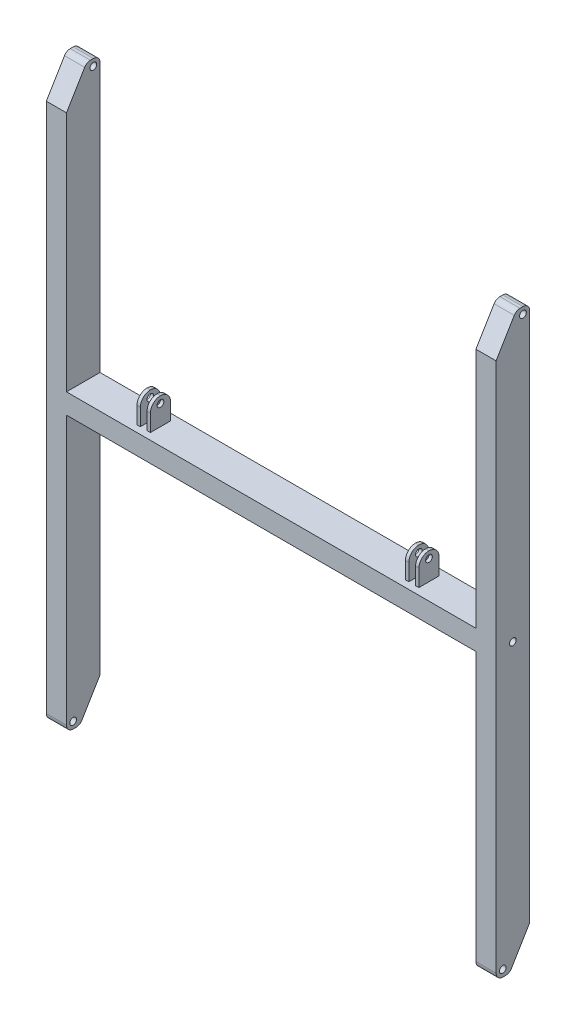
ISO-10303-21;
HEADER;
FILE_DESCRIPTION(('STEP AP214'),'2;1');
FILE_NAME('part.step','',(''),(''),'','','');
FILE_SCHEMA(('AUTOMOTIVE_DESIGN { 1 0 10303 214 1 1 1 1 }'));
ENDSEC;
DATA;
#1=APPLICATION_CONTEXT('core data for automotive mechanical design processes');
#2=APPLICATION_PROTOCOL_DEFINITION('international standard','automotive_design',2000,#1);
#3=PRODUCT_CONTEXT('',#1,'mechanical');
#4=PRODUCT('Part','Part','',(#3));
#5=PRODUCT_RELATED_PRODUCT_CATEGORY('part','',(#4));
#6=PRODUCT_DEFINITION_FORMATION('','',#4);
#7=PRODUCT_DEFINITION_CONTEXT('part definition',#1,'design');
#8=PRODUCT_DEFINITION('design','',#6,#7);
#9=PRODUCT_DEFINITION_SHAPE('','',#8);
#10=(LENGTH_UNIT() NAMED_UNIT(*) SI_UNIT(.MILLI.,.METRE.));
#11=(NAMED_UNIT(*) PLANE_ANGLE_UNIT() SI_UNIT($,.RADIAN.));
#12=(NAMED_UNIT(*) SI_UNIT($,.STERADIAN.) SOLID_ANGLE_UNIT());
#13=UNCERTAINTY_MEASURE_WITH_UNIT(LENGTH_MEASURE(1.E-05),#10,'distance_accuracy_value','');
#14=(GEOMETRIC_REPRESENTATION_CONTEXT(3) GLOBAL_UNCERTAINTY_ASSIGNED_CONTEXT((#13)) GLOBAL_UNIT_ASSIGNED_CONTEXT((#10,
#11,#12)) REPRESENTATION_CONTEXT('',''));
#15=CARTESIAN_POINT('',(0.,0.,0.));
#16=DIRECTION('',(0.,0.,1.));
#17=DIRECTION('',(1.,0.,0.));
#18=AXIS2_PLACEMENT_3D('',#15,#16,#17);
#19=CARTESIAN_POINT('',(420.,110.,30.));
#20=DIRECTION('',(0.,0.,1.));
#21=DIRECTION('',(1.,0.,0.));
#22=AXIS2_PLACEMENT_3D('',#19,#20,#21);
#23=PLANE('',#22);
#24=DIRECTION('',(-1.,0.,0.));
#25=VECTOR('',#24,1.);
#26=CARTESIAN_POINT('',(420.,30.,30.));
#27=LINE('',#26,#25);
#28=CARTESIAN_POINT('',(390.,30.,30.));
#29=VERTEX_POINT('',#28);
#30=CARTESIAN_POINT('',(380.,30.,30.));
#31=VERTEX_POINT('',#30);
#32=EDGE_CURVE('E565',#29,#31,#27,.T.);
#33=ORIENTED_EDGE('',*,*,#32,.F.);
#34=DIRECTION('',(0.,1.,0.));
#35=VECTOR('',#34,1.);
#36=CARTESIAN_POINT('',(390.,110.,30.));
#37=LINE('',#36,#35);
#38=CARTESIAN_POINT('',(390.,80.,30.));
#39=VERTEX_POINT('',#38);
#40=EDGE_CURVE('E530',#29,#39,#37,.T.);
#41=ORIENTED_EDGE('',*,*,#40,.T.);
#42=DIRECTION('',(-1.,0.,0.));
#43=VECTOR('',#42,1.);
#44=CARTESIAN_POINT('',(420.,80.,30.));
#45=LINE('',#44,#43);
#46=CARTESIAN_POINT('',(380.,80.,30.));
#47=VERTEX_POINT('',#46);
#48=EDGE_CURVE('E458',#39,#47,#45,.T.);
#49=ORIENTED_EDGE('',*,*,#48,.T.);
#50=DIRECTION('',(0.,-1.,0.));
#51=VECTOR('',#50,1.);
#52=CARTESIAN_POINT('',(380.,110.,30.));
#53=LINE('',#52,#51);
#54=EDGE_CURVE('E583',#47,#31,#53,.T.);
#55=ORIENTED_EDGE('',*,*,#54,.T.);
#56=EDGE_LOOP('',(#33,#41,#49,#55));
#57=FACE_BOUND('',#56,.T.);
#58=ADVANCED_FACE('F41',(#57),#23,.T.);
#59=CARTESIAN_POINT('',(420.,80.,30.));
#60=VERTEX_POINT('',#59);
#61=CARTESIAN_POINT('',(410.,80.,30.));
#62=VERTEX_POINT('',#61);
#63=EDGE_CURVE('E459',#60,#62,#45,.T.);
#64=ORIENTED_EDGE('',*,*,#63,.T.);
#65=DIRECTION('',(0.,-1.,0.));
#66=VECTOR('',#65,1.);
#67=CARTESIAN_POINT('',(410.,110.,30.));
#68=LINE('',#67,#66);
#69=CARTESIAN_POINT('',(410.,30.,30.));
#70=VERTEX_POINT('',#69);
#71=EDGE_CURVE('E536',#62,#70,#68,.T.);
#72=ORIENTED_EDGE('',*,*,#71,.T.);
#73=CARTESIAN_POINT('',(420.,30.,30.));
#74=VERTEX_POINT('',#73);
#75=EDGE_CURVE('E566',#74,#70,#27,.T.);
#76=ORIENTED_EDGE('',*,*,#75,.F.);
#77=DIRECTION('',(0.,-1.,0.));
#78=VECTOR('',#77,1.);
#79=CARTESIAN_POINT('',(420.,110.,30.));
#80=LINE('',#79,#78);
#81=EDGE_CURVE('E581',#60,#74,#80,.T.);
#82=ORIENTED_EDGE('',*,*,#81,.F.);
#83=EDGE_LOOP('',(#64,#72,#76,#82));
#84=FACE_BOUND('',#83,.T.);
#85=ADVANCED_FACE('F721',(#84),#23,.T.);
#86=CARTESIAN_POINT('',(420.,110.,-30.));
#87=DIRECTION('',(0.,0.,-1.));
#88=DIRECTION('',(-1.,0.,0.));
#89=AXIS2_PLACEMENT_3D('',#86,#87,#88);
#90=PLANE('',#89);
#91=DIRECTION('',(1.,0.,0.));
#92=VECTOR('',#91,1.);
#93=CARTESIAN_POINT('',(420.,80.,-30.));
#94=LINE('',#93,#92);
#95=CARTESIAN_POINT('',(380.,80.,-30.));
#96=VERTEX_POINT('',#95);
#97=CARTESIAN_POINT('',(390.,80.,-30.));
#98=VERTEX_POINT('',#97);
#99=EDGE_CURVE('E446',#96,#98,#94,.T.);
#100=ORIENTED_EDGE('',*,*,#99,.T.);
#101=DIRECTION('',(0.,-1.,0.));
#102=VECTOR('',#101,1.);
#103=CARTESIAN_POINT('',(390.,110.,-30.));
#104=LINE('',#103,#102);
#105=CARTESIAN_POINT('',(390.,30.,-30.));
#106=VERTEX_POINT('',#105);
#107=EDGE_CURVE('E555',#98,#106,#104,.T.);
#108=ORIENTED_EDGE('',*,*,#107,.T.);
#109=DIRECTION('',(1.,0.,0.));
#110=VECTOR('',#109,1.);
#111=CARTESIAN_POINT('',(420.,30.,-30.));
#112=LINE('',#111,#110);
#113=CARTESIAN_POINT('',(380.,30.,-30.));
#114=VERTEX_POINT('',#113);
#115=EDGE_CURVE('E573',#114,#106,#112,.T.);
#116=ORIENTED_EDGE('',*,*,#115,.F.);
#117=DIRECTION('',(0.,-1.,0.));
#118=VECTOR('',#117,1.);
#119=CARTESIAN_POINT('',(380.,110.,-30.));
#120=LINE('',#119,#118);
#121=EDGE_CURVE('E576',#96,#114,#120,.T.);
#122=ORIENTED_EDGE('',*,*,#121,.F.);
#123=EDGE_LOOP('',(#100,#108,#116,#122));
#124=FACE_BOUND('',#123,.T.);
#125=ADVANCED_FACE('F728',(#124),#90,.T.);
#126=CARTESIAN_POINT('',(410.,30.,-30.));
#127=VERTEX_POINT('',#126);
#128=CARTESIAN_POINT('',(420.,30.,-30.));
#129=VERTEX_POINT('',#128);
#130=EDGE_CURVE('E572',#127,#129,#112,.T.);
#131=ORIENTED_EDGE('',*,*,#130,.F.);
#132=DIRECTION('',(0.,1.,0.));
#133=VECTOR('',#132,1.);
#134=CARTESIAN_POINT('',(410.,110.,-30.));
#135=LINE('',#134,#133);
#136=CARTESIAN_POINT('',(410.,80.,-30.));
#137=VERTEX_POINT('',#136);
#138=EDGE_CURVE('E546',#127,#137,#135,.T.);
#139=ORIENTED_EDGE('',*,*,#138,.T.);
#140=CARTESIAN_POINT('',(420.,80.,-30.));
#141=VERTEX_POINT('',#140);
#142=EDGE_CURVE('E440',#137,#141,#94,.T.);
#143=ORIENTED_EDGE('',*,*,#142,.T.);
#144=DIRECTION('',(0.,-1.,0.));
#145=VECTOR('',#144,1.);
#146=CARTESIAN_POINT('',(420.,110.,-30.));
#147=LINE('',#146,#145);
#148=EDGE_CURVE('E578',#141,#129,#147,.T.);
#149=ORIENTED_EDGE('',*,*,#148,.T.);
#150=EDGE_LOOP('',(#131,#139,#143,#149));
#151=FACE_BOUND('',#150,.T.);
#152=ADVANCED_FACE('F1011',(#151),#90,.T.);
#153=CARTESIAN_POINT('',(460.,90.,0.));
#154=DIRECTION('',(-1.,0.,0.));
#155=DIRECTION('',(0.,0.,1.));
#156=AXIS2_PLACEMENT_3D('',#153,#154,#155);
#157=CYLINDRICAL_SURFACE('',#156,10.);
#158=CARTESIAN_POINT('',(380.,90.,0.));
#159=DIRECTION('',(1.,0.,0.));
#160=DIRECTION('',(0.,0.,-1.));
#161=AXIS2_PLACEMENT_3D('',#158,#159,#160);
#162=CIRCLE('',#161,10.);
#163=CARTESIAN_POINT('',(380.,90.,-10.));
#164=VERTEX_POINT('',#163);
#165=EDGE_CURVE('E445',#164,#164,#162,.T.);
#166=ORIENTED_EDGE('',*,*,#165,.F.);
#167=EDGE_LOOP('',(#166));
#168=FACE_BOUND('',#167,.T.);
#169=CARTESIAN_POINT('',(390.,90.,0.));
#170=DIRECTION('',(1.,0.,0.));
#171=DIRECTION('',(0.,0.,-1.));
#172=AXIS2_PLACEMENT_3D('',#169,#170,#171);
#173=CIRCLE('',#172,10.);
#174=CARTESIAN_POINT('',(390.,90.,-10.));
#175=VERTEX_POINT('',#174);
#176=EDGE_CURVE('E558',#175,#175,#173,.T.);
#177=ORIENTED_EDGE('',*,*,#176,.T.);
#178=EDGE_LOOP('',(#177));
#179=FACE_BOUND('',#178,.T.);
#180=ADVANCED_FACE('F1003',(#168,#179),#157,.F.);
#181=CARTESIAN_POINT('',(420.,90.,0.));
#182=DIRECTION('',(1.,0.,0.));
#183=DIRECTION('',(0.,0.,-1.));
#184=AXIS2_PLACEMENT_3D('',#181,#182,#183);
#185=CIRCLE('',#184,10.);
#186=CARTESIAN_POINT('',(420.,90.,-10.));
#187=VERTEX_POINT('',#186);
#188=EDGE_CURVE('E441',#187,#187,#185,.F.);
#189=ORIENTED_EDGE('',*,*,#188,.F.);
#190=EDGE_LOOP('',(#189));
#191=FACE_BOUND('',#190,.T.);
#192=CARTESIAN_POINT('',(410.,90.,0.));
#193=DIRECTION('',(-1.,0.,0.));
#194=DIRECTION('',(0.,0.,1.));
#195=AXIS2_PLACEMENT_3D('',#192,#193,#194);
#196=CIRCLE('',#195,10.);
#197=CARTESIAN_POINT('',(410.,90.,10.));
#198=VERTEX_POINT('',#197);
#199=EDGE_CURVE('E549',#198,#198,#196,.T.);
#200=ORIENTED_EDGE('',*,*,#199,.T.);
#201=EDGE_LOOP('',(#200));
#202=FACE_BOUND('',#201,.T.);
#203=ADVANCED_FACE('F853',(#191,#202),#157,.F.);
#204=CARTESIAN_POINT('',(420.,80.,0.));
#205=DIRECTION('',(-1.,0.,0.));
#206=DIRECTION('',(0.,0.,1.));
#207=AXIS2_PLACEMENT_3D('',#204,#205,#206);
#208=CYLINDRICAL_SURFACE('',#207,30.);
#209=ORIENTED_EDGE('',*,*,#48,.F.);
#210=CARTESIAN_POINT('',(390.,80.,0.));
#211=DIRECTION('',(1.,0.,0.));
#212=DIRECTION('',(0.,0.,-1.));
#213=AXIS2_PLACEMENT_3D('',#210,#211,#212);
#214=CIRCLE('',#213,30.);
#215=CARTESIAN_POINT('',(390.,110.,0.));
#216=VERTEX_POINT('',#215);
#217=EDGE_CURVE('E552',#39,#216,#214,.F.);
#218=ORIENTED_EDGE('',*,*,#217,.T.);
#219=DIRECTION('',(-1.,0.,0.));
#220=VECTOR('',#219,1.);
#221=CARTESIAN_POINT('',(0.,110.,0.));
#222=LINE('',#221,#220);
#223=CARTESIAN_POINT('',(380.,110.,0.));
#224=VERTEX_POINT('',#223);
#225=EDGE_CURVE('E463',#224,#216,#222,.F.);
#226=ORIENTED_EDGE('',*,*,#225,.F.);
#227=CARTESIAN_POINT('',(380.,80.,0.));
#228=DIRECTION('',(-1.,0.,0.));
#229=DIRECTION('',(0.,0.,1.));
#230=AXIS2_PLACEMENT_3D('',#227,#228,#229);
#231=CIRCLE('',#230,30.);
#232=EDGE_CURVE('E454',#47,#224,#231,.T.);
#233=ORIENTED_EDGE('',*,*,#232,.F.);
#234=EDGE_LOOP('',(#209,#218,#226,#233));
#235=FACE_BOUND('',#234,.T.);
#236=ADVANCED_FACE('F850',(#235),#208,.T.);
#237=CARTESIAN_POINT('',(410.,110.,0.));
#238=VERTEX_POINT('',#237);
#239=CARTESIAN_POINT('',(420.,110.,0.));
#240=VERTEX_POINT('',#239);
#241=EDGE_CURVE('E466',#238,#240,#222,.F.);
#242=ORIENTED_EDGE('',*,*,#241,.F.);
#243=CARTESIAN_POINT('',(410.,80.,0.));
#244=DIRECTION('',(-1.,0.,0.));
#245=DIRECTION('',(0.,0.,1.));
#246=AXIS2_PLACEMENT_3D('',#243,#244,#245);
#247=CIRCLE('',#246,30.);
#248=EDGE_CURVE('E542',#238,#62,#247,.F.);
#249=ORIENTED_EDGE('',*,*,#248,.T.);
#250=ORIENTED_EDGE('',*,*,#63,.F.);
#251=CARTESIAN_POINT('',(420.,80.,0.));
#252=DIRECTION('',(1.,0.,0.));
#253=DIRECTION('',(0.,0.,-1.));
#254=AXIS2_PLACEMENT_3D('',#251,#252,#253);
#255=CIRCLE('',#254,30.);
#256=EDGE_CURVE('E449',#240,#60,#255,.T.);
#257=ORIENTED_EDGE('',*,*,#256,.F.);
#258=EDGE_LOOP('',(#242,#249,#250,#257));
#259=FACE_BOUND('',#258,.T.);
#260=ADVANCED_FACE('F848',(#259),#208,.T.);
#261=CARTESIAN_POINT('',(420.,80.,0.));
#262=DIRECTION('',(1.,0.,0.));
#263=DIRECTION('',(0.,0.,-1.));
#264=AXIS2_PLACEMENT_3D('',#261,#262,#263);
#265=CYLINDRICAL_SURFACE('',#264,30.);
#266=ORIENTED_EDGE('',*,*,#225,.T.);
#267=CARTESIAN_POINT('',(390.,80.,0.));
#268=DIRECTION('',(1.,0.,0.));
#269=DIRECTION('',(0.,0.,-1.));
#270=AXIS2_PLACEMENT_3D('',#267,#268,#269);
#271=CIRCLE('',#270,30.);
#272=EDGE_CURVE('E469',#216,#98,#271,.F.);
#273=ORIENTED_EDGE('',*,*,#272,.T.);
#274=ORIENTED_EDGE('',*,*,#99,.F.);
#275=CARTESIAN_POINT('',(380.,80.,0.));
#276=DIRECTION('',(-1.,0.,0.));
#277=DIRECTION('',(0.,0.,1.));
#278=AXIS2_PLACEMENT_3D('',#275,#276,#277);
#279=CIRCLE('',#278,30.);
#280=EDGE_CURVE('E456',#224,#96,#279,.T.);
#281=ORIENTED_EDGE('',*,*,#280,.F.);
#282=EDGE_LOOP('',(#266,#273,#274,#281));
#283=FACE_BOUND('',#282,.T.);
#284=ADVANCED_FACE('F844',(#283),#265,.T.);
#285=ORIENTED_EDGE('',*,*,#142,.F.);
#286=CARTESIAN_POINT('',(410.,80.,0.));
#287=DIRECTION('',(-1.,0.,0.));
#288=DIRECTION('',(0.,0.,1.));
#289=AXIS2_PLACEMENT_3D('',#286,#287,#288);
#290=CIRCLE('',#289,30.);
#291=EDGE_CURVE('E462',#137,#238,#290,.F.);
#292=ORIENTED_EDGE('',*,*,#291,.T.);
#293=ORIENTED_EDGE('',*,*,#241,.T.);
#294=CARTESIAN_POINT('',(420.,80.,0.));
#295=DIRECTION('',(1.,0.,0.));
#296=DIRECTION('',(0.,0.,-1.));
#297=AXIS2_PLACEMENT_3D('',#294,#295,#296);
#298=CIRCLE('',#297,30.);
#299=EDGE_CURVE('E451',#141,#240,#298,.T.);
#300=ORIENTED_EDGE('',*,*,#299,.F.);
#301=EDGE_LOOP('',(#285,#292,#293,#300));
#302=FACE_BOUND('',#301,.T.);
#303=ADVANCED_FACE('F847',(#302),#265,.T.);
#304=CARTESIAN_POINT('',(-420.,110.,-30.));
#305=DIRECTION('',(0.,0.,1.));
#306=DIRECTION('',(1.,0.,0.));
#307=AXIS2_PLACEMENT_3D('',#304,#305,#306);
#308=PLANE('',#307);
#309=DIRECTION('',(-1.,0.,0.));
#310=VECTOR('',#309,1.);
#311=CARTESIAN_POINT('',(-420.,30.,-30.));
#312=LINE('',#311,#310);
#313=CARTESIAN_POINT('',(-380.,30.,-30.));
#314=VERTEX_POINT('',#313);
#315=CARTESIAN_POINT('',(-390.,30.,-30.));
#316=VERTEX_POINT('',#315);
#317=EDGE_CURVE('E648',#314,#316,#312,.T.);
#318=ORIENTED_EDGE('',*,*,#317,.T.);
#319=DIRECTION('',(0.,1.,0.));
#320=VECTOR('',#319,1.);
#321=CARTESIAN_POINT('',(-390.,110.,-30.));
#322=LINE('',#321,#320);
#323=CARTESIAN_POINT('',(-390.,80.,-30.));
#324=VERTEX_POINT('',#323);
#325=EDGE_CURVE('E637',#316,#324,#322,.T.);
#326=ORIENTED_EDGE('',*,*,#325,.T.);
#327=DIRECTION('',(-1.,0.,0.));
#328=VECTOR('',#327,1.);
#329=CARTESIAN_POINT('',(-380.,80.,-30.));
#330=LINE('',#329,#328);
#331=CARTESIAN_POINT('',(-380.,80.,-30.));
#332=VERTEX_POINT('',#331);
#333=EDGE_CURVE('E383',#324,#332,#330,.F.);
#334=ORIENTED_EDGE('',*,*,#333,.T.);
#335=DIRECTION('',(0.,-1.,0.));
#336=VECTOR('',#335,1.);
#337=CARTESIAN_POINT('',(-380.,110.,-30.));
#338=LINE('',#337,#336);
#339=EDGE_CURVE('E666',#332,#314,#338,.T.);
#340=ORIENTED_EDGE('',*,*,#339,.T.);
#341=EDGE_LOOP('',(#318,#326,#334,#340));
#342=FACE_BOUND('',#341,.T.);
#343=ADVANCED_FACE('F794',(#342),#308,.F.);
#344=CARTESIAN_POINT('',(-420.,110.,30.));
#345=DIRECTION('',(0.,0.,-1.));
#346=DIRECTION('',(-1.,0.,0.));
#347=AXIS2_PLACEMENT_3D('',#344,#345,#346);
#348=PLANE('',#347);
#349=DIRECTION('',(1.,0.,0.));
#350=VECTOR('',#349,1.);
#351=CARTESIAN_POINT('',(-420.,80.,30.));
#352=LINE('',#351,#350);
#353=CARTESIAN_POINT('',(-380.,80.,30.));
#354=VERTEX_POINT('',#353);
#355=CARTESIAN_POINT('',(-390.,80.,30.));
#356=VERTEX_POINT('',#355);
#357=EDGE_CURVE('E393',#354,#356,#352,.F.);
#358=ORIENTED_EDGE('',*,*,#357,.T.);
#359=DIRECTION('',(0.,1.,0.));
#360=VECTOR('',#359,1.);
#361=CARTESIAN_POINT('',(-390.,110.,30.));
#362=LINE('',#361,#360);
#363=CARTESIAN_POINT('',(-390.,30.,30.));
#364=VERTEX_POINT('',#363);
#365=EDGE_CURVE('E615',#364,#356,#362,.T.);
#366=ORIENTED_EDGE('',*,*,#365,.F.);
#367=DIRECTION('',(1.,0.,0.));
#368=VECTOR('',#367,1.);
#369=CARTESIAN_POINT('',(-420.,30.,30.));
#370=LINE('',#369,#368);
#371=CARTESIAN_POINT('',(-380.,30.,30.));
#372=VERTEX_POINT('',#371);
#373=EDGE_CURVE('E654',#364,#372,#370,.T.);
#374=ORIENTED_EDGE('',*,*,#373,.T.);
#375=DIRECTION('',(0.,-1.,0.));
#376=VECTOR('',#375,1.);
#377=CARTESIAN_POINT('',(-380.,110.,30.));
#378=LINE('',#377,#376);
#379=EDGE_CURVE('E658',#354,#372,#378,.T.);
#380=ORIENTED_EDGE('',*,*,#379,.F.);
#381=EDGE_LOOP('',(#358,#366,#374,#380));
#382=FACE_BOUND('',#381,.T.);
#383=ADVANCED_FACE('F785',(#382),#348,.F.);
#384=CARTESIAN_POINT('',(-460.,90.,0.));
#385=DIRECTION('',(1.,0.,0.));
#386=DIRECTION('',(0.,0.,-1.));
#387=AXIS2_PLACEMENT_3D('',#384,#385,#386);
#388=CYLINDRICAL_SURFACE('',#387,10.);
#389=CARTESIAN_POINT('',(-390.,90.,0.));
#390=DIRECTION('',(1.,0.,0.));
#391=DIRECTION('',(0.,0.,-1.));
#392=AXIS2_PLACEMENT_3D('',#389,#390,#391);
#393=CIRCLE('',#392,10.);
#394=CARTESIAN_POINT('',(-390.,90.,-10.));
#395=VERTEX_POINT('',#394);
#396=EDGE_CURVE('E640',#395,#395,#393,.F.);
#397=ORIENTED_EDGE('',*,*,#396,.T.);
#398=EDGE_LOOP('',(#397));
#399=FACE_BOUND('',#398,.T.);
#400=CARTESIAN_POINT('',(-380.,90.,0.));
#401=DIRECTION('',(1.,0.,0.));
#402=DIRECTION('',(0.,0.,-1.));
#403=AXIS2_PLACEMENT_3D('',#400,#401,#402);
#404=CIRCLE('',#403,10.);
#405=CARTESIAN_POINT('',(-380.,90.,-10.));
#406=VERTEX_POINT('',#405);
#407=EDGE_CURVE('E379',#406,#406,#404,.T.);
#408=ORIENTED_EDGE('',*,*,#407,.T.);
#409=EDGE_LOOP('',(#408));
#410=FACE_BOUND('',#409,.T.);
#411=ADVANCED_FACE('F780',(#399,#410),#388,.F.);
#412=CARTESIAN_POINT('',(0.,80.,0.));
#413=DIRECTION('',(-1.,0.,0.));
#414=DIRECTION('',(0.,0.,1.));
#415=AXIS2_PLACEMENT_3D('',#412,#413,#414);
#416=CYLINDRICAL_SURFACE('',#415,30.);
#417=CARTESIAN_POINT('',(-390.,80.,0.));
#418=DIRECTION('',(1.,0.,0.));
#419=DIRECTION('',(0.,0.,-1.));
#420=AXIS2_PLACEMENT_3D('',#417,#418,#419);
#421=CIRCLE('',#420,30.);
#422=CARTESIAN_POINT('',(-390.,110.,0.));
#423=VERTEX_POINT('',#422);
#424=EDGE_CURVE('E635',#356,#423,#421,.F.);
#425=ORIENTED_EDGE('',*,*,#424,.F.);
#426=ORIENTED_EDGE('',*,*,#357,.F.);
#427=CARTESIAN_POINT('',(-380.,80.,0.));
#428=DIRECTION('',(-1.,0.,0.));
#429=DIRECTION('',(0.,0.,1.));
#430=AXIS2_PLACEMENT_3D('',#427,#428,#429);
#431=CIRCLE('',#430,30.);
#432=CARTESIAN_POINT('',(-380.,110.,0.));
#433=VERTEX_POINT('',#432);
#434=EDGE_CURVE('E387',#433,#354,#431,.F.);
#435=ORIENTED_EDGE('',*,*,#434,.F.);
#436=DIRECTION('',(1.,0.,0.));
#437=VECTOR('',#436,1.);
#438=CARTESIAN_POINT('',(-380.,110.,0.));
#439=LINE('',#438,#437);
#440=EDGE_CURVE('E400',#423,#433,#439,.T.);
#441=ORIENTED_EDGE('',*,*,#440,.F.);
#442=EDGE_LOOP('',(#425,#426,#435,#441));
#443=FACE_BOUND('',#442,.T.);
#444=ADVANCED_FACE('F830',(#443),#416,.T.);
#445=CARTESIAN_POINT('',(0.,80.,0.));
#446=DIRECTION('',(1.,0.,0.));
#447=DIRECTION('',(0.,0.,-1.));
#448=AXIS2_PLACEMENT_3D('',#445,#446,#447);
#449=CYLINDRICAL_SURFACE('',#448,30.);
#450=CARTESIAN_POINT('',(-390.,80.,0.));
#451=DIRECTION('',(1.,0.,0.));
#452=DIRECTION('',(0.,0.,-1.));
#453=AXIS2_PLACEMENT_3D('',#450,#451,#452);
#454=CIRCLE('',#453,30.);
#455=EDGE_CURVE('E402',#423,#324,#454,.F.);
#456=ORIENTED_EDGE('',*,*,#455,.F.);
#457=ORIENTED_EDGE('',*,*,#440,.T.);
#458=CARTESIAN_POINT('',(-380.,80.,0.));
#459=DIRECTION('',(-1.,0.,0.));
#460=DIRECTION('',(0.,0.,1.));
#461=AXIS2_PLACEMENT_3D('',#458,#459,#460);
#462=CIRCLE('',#461,30.);
#463=EDGE_CURVE('E389',#332,#433,#462,.F.);
#464=ORIENTED_EDGE('',*,*,#463,.F.);
#465=ORIENTED_EDGE('',*,*,#333,.F.);
#466=EDGE_LOOP('',(#456,#457,#464,#465));
#467=FACE_BOUND('',#466,.T.);
#468=ADVANCED_FACE('F812',(#467),#449,.T.);
#469=CARTESIAN_POINT('',(0.,30.,50.));
#470=DIRECTION('',(0.,1.,0.));
#471=DIRECTION('',(0.,0.,1.));
#472=AXIS2_PLACEMENT_3D('',#469,#470,#471);
#473=PLANE('',#472);
#474=DIRECTION('',(0.,0.,-1.));
#475=VECTOR('',#474,1.);
#476=CARTESIAN_POINT('',(610.,30.,50.));
#477=LINE('',#476,#475);
#478=CARTESIAN_POINT('',(610.,30.,50.));
#479=VERTEX_POINT('',#478);
#480=CARTESIAN_POINT('',(610.,30.,-50.));
#481=VERTEX_POINT('',#480);
#482=EDGE_CURVE('E365',#479,#481,#477,.T.);
#483=ORIENTED_EDGE('',*,*,#482,.T.);
#484=DIRECTION('',(1.,0.,0.));
#485=VECTOR('',#484,1.);
#486=CARTESIAN_POINT('',(0.,30.,-50.));
#487=LINE('',#486,#485);
#488=CARTESIAN_POINT('',(-610.,30.,-50.));
#489=VERTEX_POINT('',#488);
#490=EDGE_CURVE('E358',#489,#481,#487,.T.);
#491=ORIENTED_EDGE('',*,*,#490,.F.);
#492=DIRECTION('',(0.,0.,-1.));
#493=VECTOR('',#492,1.);
#494=CARTESIAN_POINT('',(-610.,30.,50.));
#495=LINE('',#494,#493);
#496=CARTESIAN_POINT('',(-610.,30.,50.));
#497=VERTEX_POINT('',#496);
#498=EDGE_CURVE('E362',#497,#489,#495,.T.);
#499=ORIENTED_EDGE('',*,*,#498,.F.);
#500=DIRECTION('',(1.,0.,0.));
#501=VECTOR('',#500,1.);
#502=CARTESIAN_POINT('',(0.,30.,50.));
#503=LINE('',#502,#501);
#504=EDGE_CURVE('E688',#497,#479,#503,.T.);
#505=ORIENTED_EDGE('',*,*,#504,.T.);
#506=EDGE_LOOP('',(#483,#491,#499,#505));
#507=FACE_BOUND('',#506,.T.);
#508=DIRECTION('',(0.,0.,1.));
#509=VECTOR('',#508,1.);
#510=CARTESIAN_POINT('',(410.,30.,-50.));
#511=LINE('',#510,#509);
#512=EDGE_CURVE('E540',#127,#70,#511,.T.);
#513=ORIENTED_EDGE('',*,*,#512,.F.);
#514=ORIENTED_EDGE('',*,*,#130,.T.);
#515=DIRECTION('',(0.,0.,1.));
#516=VECTOR('',#515,1.);
#517=CARTESIAN_POINT('',(420.,30.,-30.));
#518=LINE('',#517,#516);
#519=EDGE_CURVE('E569',#129,#74,#518,.T.);
#520=ORIENTED_EDGE('',*,*,#519,.T.);
#521=ORIENTED_EDGE('',*,*,#75,.T.);
#522=EDGE_LOOP('',(#513,#514,#520,#521));
#523=FACE_BOUND('',#522,.T.);
#524=ORIENTED_EDGE('',*,*,#115,.T.);
#525=DIRECTION('',(0.,0.,1.));
#526=VECTOR('',#525,1.);
#527=CARTESIAN_POINT('',(390.,30.,-50.));
#528=LINE('',#527,#526);
#529=EDGE_CURVE('E539',#106,#29,#528,.T.);
#530=ORIENTED_EDGE('',*,*,#529,.T.);
#531=ORIENTED_EDGE('',*,*,#32,.T.);
#532=DIRECTION('',(0.,0.,-1.));
#533=VECTOR('',#532,1.);
#534=CARTESIAN_POINT('',(380.,30.,-30.));
#535=LINE('',#534,#533);
#536=EDGE_CURVE('E444',#31,#114,#535,.T.);
#537=ORIENTED_EDGE('',*,*,#536,.T.);
#538=EDGE_LOOP('',(#524,#530,#531,#537));
#539=FACE_BOUND('',#538,.T.);
#540=CARTESIAN_POINT('',(-410.,30.,-30.));
#541=VERTEX_POINT('',#540);
#542=CARTESIAN_POINT('',(-420.,30.,-30.));
#543=VERTEX_POINT('',#542);
#544=EDGE_CURVE('E647',#541,#543,#312,.T.);
#545=ORIENTED_EDGE('',*,*,#544,.F.);
#546=DIRECTION('',(0.,0.,1.));
#547=VECTOR('',#546,1.);
#548=CARTESIAN_POINT('',(-410.,30.,-50.));
#549=LINE('',#548,#547);
#550=CARTESIAN_POINT('',(-410.,30.,30.));
#551=VERTEX_POINT('',#550);
#552=EDGE_CURVE('E623',#541,#551,#549,.T.);
#553=ORIENTED_EDGE('',*,*,#552,.T.);
#554=CARTESIAN_POINT('',(-420.,30.,30.));
#555=VERTEX_POINT('',#554);
#556=EDGE_CURVE('E655',#555,#551,#370,.T.);
#557=ORIENTED_EDGE('',*,*,#556,.F.);
#558=DIRECTION('',(0.,0.,1.));
#559=VECTOR('',#558,1.);
#560=CARTESIAN_POINT('',(-420.,30.,-30.));
#561=LINE('',#560,#559);
#562=EDGE_CURVE('E651',#543,#555,#561,.T.);
#563=ORIENTED_EDGE('',*,*,#562,.F.);
#564=EDGE_LOOP('',(#545,#553,#557,#563));
#565=FACE_BOUND('',#564,.T.);
#566=DIRECTION('',(0.,0.,1.));
#567=VECTOR('',#566,1.);
#568=CARTESIAN_POINT('',(-390.,30.,-50.));
#569=LINE('',#568,#567);
#570=EDGE_CURVE('E624',#316,#364,#569,.T.);
#571=ORIENTED_EDGE('',*,*,#570,.F.);
#572=ORIENTED_EDGE('',*,*,#317,.F.);
#573=DIRECTION('',(0.,0.,-1.));
#574=VECTOR('',#573,1.);
#575=CARTESIAN_POINT('',(-380.,30.,-30.));
#576=LINE('',#575,#574);
#577=EDGE_CURVE('E378',#372,#314,#576,.T.);
#578=ORIENTED_EDGE('',*,*,#577,.F.);
#579=ORIENTED_EDGE('',*,*,#373,.F.);
#580=EDGE_LOOP('',(#571,#572,#578,#579));
#581=FACE_BOUND('',#580,.T.);
#582=ADVANCED_FACE('F808',(#507,#523,#539,#565,#581),#473,.T.);
#583=CARTESIAN_POINT('',(-670.,0.,50.));
#584=DIRECTION('',(1.,0.,0.));
#585=DIRECTION('',(0.,1.,0.));
#586=AXIS2_PLACEMENT_3D('',#583,#584,#585);
#587=PLANE('',#586);
#588=CARTESIAN_POINT('',(-670.,0.,0.));
#589=DIRECTION('',(1.,0.,0.));
#590=DIRECTION('',(0.,1.,0.));
#591=AXIS2_PLACEMENT_3D('',#588,#589,#590);
#592=CIRCLE('',#591,10.);
#593=CARTESIAN_POINT('',(-670.,0.,-10.));
#594=VERTEX_POINT('',#593);
#595=EDGE_CURVE('E1154',#594,#594,#592,.T.);
#596=ORIENTED_EDGE('',*,*,#595,.T.);
#597=EDGE_LOOP('',(#596));
#598=FACE_BOUND('',#597,.T.);
#599=DIRECTION('',(0.,-0.857492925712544,0.514495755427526));
#600=VECTOR('',#599,1.);
#601=CARTESIAN_POINT('',(-670.,750.,50.));
#602=LINE('',#601,#600);
#603=CARTESIAN_POINT('',(-670.,840.28991510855,-4.17394906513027));
#604=VERTEX_POINT('',#603);
#605=CARTESIAN_POINT('',(-670.,750.,50.));
#606=VERTEX_POINT('',#605);
#607=EDGE_CURVE('E612',#604,#606,#602,.T.);
#608=ORIENTED_EDGE('',*,*,#607,.F.);
#609=CARTESIAN_POINT('',(-670.,830.,-21.3238075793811));
#610=DIRECTION('',(1.,0.,0.));
#611=DIRECTION('',(0.,1.,0.));
#612=AXIS2_PLACEMENT_3D('',#609,#610,#611);
#613=CIRCLE('',#612,20.);
#614=CARTESIAN_POINT('',(-670.,850.,-21.3238075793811));
#615=VERTEX_POINT('',#614);
#616=EDGE_CURVE('E421',#604,#615,#613,.F.);
#617=ORIENTED_EDGE('',*,*,#616,.T.);
#618=DIRECTION('',(0.,0.,1.));
#619=VECTOR('',#618,1.);
#620=CARTESIAN_POINT('',(-670.,850.,-9.99999999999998));
#621=LINE('',#620,#619);
#622=CARTESIAN_POINT('',(-670.,850.,-30.));
#623=VERTEX_POINT('',#622);
#624=EDGE_CURVE('E609',#623,#615,#621,.T.);
#625=ORIENTED_EDGE('',*,*,#624,.F.);
#626=CARTESIAN_POINT('',(-670.,830.,-30.));
#627=DIRECTION('',(1.,0.,0.));
#628=DIRECTION('',(0.,1.,0.));
#629=AXIS2_PLACEMENT_3D('',#626,#627,#628);
#630=CIRCLE('',#629,20.);
#631=CARTESIAN_POINT('',(-670.,830.,-50.));
#632=VERTEX_POINT('',#631);
#633=EDGE_CURVE('E419',#623,#632,#630,.F.);
#634=ORIENTED_EDGE('',*,*,#633,.T.);
#635=DIRECTION('',(0.,-1.,0.));
#636=VECTOR('',#635,1.);
#637=CARTESIAN_POINT('',(-670.,0.,-50.));
#638=LINE('',#637,#636);
#639=CARTESIAN_POINT('',(-670.,-750.,-50.));
#640=VERTEX_POINT('',#639);
#641=EDGE_CURVE('E668',#632,#640,#638,.T.);
#642=ORIENTED_EDGE('',*,*,#641,.T.);
#643=DIRECTION('',(0.,0.857492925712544,-0.514495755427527));
#644=VECTOR('',#643,1.);
#645=CARTESIAN_POINT('',(-670.,-850.,9.99999999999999));
#646=LINE('',#645,#644);
#647=CARTESIAN_POINT('',(-670.,-840.289915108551,4.17394906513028));
#648=VERTEX_POINT('',#647);
#649=EDGE_CURVE('E596',#648,#640,#646,.T.);
#650=ORIENTED_EDGE('',*,*,#649,.F.);
#651=CARTESIAN_POINT('',(-670.,-830.,21.3238075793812));
#652=DIRECTION('',(1.,0.,0.));
#653=DIRECTION('',(0.,1.,0.));
#654=AXIS2_PLACEMENT_3D('',#651,#652,#653);
#655=CIRCLE('',#654,20.);
#656=CARTESIAN_POINT('',(-670.,-850.,21.3238075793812));
#657=VERTEX_POINT('',#656);
#658=EDGE_CURVE('E417',#648,#657,#655,.F.);
#659=ORIENTED_EDGE('',*,*,#658,.T.);
#660=DIRECTION('',(0.,0.,-1.));
#661=VECTOR('',#660,1.);
#662=CARTESIAN_POINT('',(-670.,-850.,50.));
#663=LINE('',#662,#661);
#664=CARTESIAN_POINT('',(-670.,-850.,30.));
#665=VERTEX_POINT('',#664);
#666=EDGE_CURVE('E593',#665,#657,#663,.T.);
#667=ORIENTED_EDGE('',*,*,#666,.F.);
#668=CARTESIAN_POINT('',(-670.,-830.,30.));
#669=DIRECTION('',(1.,0.,0.));
#670=DIRECTION('',(0.,1.,0.));
#671=AXIS2_PLACEMENT_3D('',#668,#669,#670);
#672=CIRCLE('',#671,20.);
#673=CARTESIAN_POINT('',(-670.,-830.,50.));
#674=VERTEX_POINT('',#673);
#675=EDGE_CURVE('E415',#665,#674,#672,.F.);
#676=ORIENTED_EDGE('',*,*,#675,.T.);
#677=DIRECTION('',(0.,-1.,0.));
#678=VECTOR('',#677,1.);
#679=CARTESIAN_POINT('',(-670.,0.,50.));
#680=LINE('',#679,#678);
#681=EDGE_CURVE('E672',#606,#674,#680,.T.);
#682=ORIENTED_EDGE('',*,*,#681,.F.);
#683=EDGE_LOOP('',(#608,#617,#625,#634,#642,#650,#659,#667,#676,#682));
#684=FACE_BOUND('',#683,.T.);
#685=CARTESIAN_POINT('',(-670.,830.,-30.));
#686=DIRECTION('',(1.,0.,0.));
#687=DIRECTION('',(0.,0.,-1.));
#688=AXIS2_PLACEMENT_3D('',#685,#686,#687);
#689=CIRCLE('',#688,10.);
#690=CARTESIAN_POINT('',(-670.,830.,-40.));
#691=VERTEX_POINT('',#690);
#692=EDGE_CURVE('E603',#691,#691,#689,.T.);
#693=ORIENTED_EDGE('',*,*,#692,.T.);
#694=EDGE_LOOP('',(#693));
#695=FACE_BOUND('',#694,.T.);
#696=CARTESIAN_POINT('',(-670.,-830.,30.));
#697=DIRECTION('',(1.,0.,0.));
#698=DIRECTION('',(0.,0.,-1.));
#699=AXIS2_PLACEMENT_3D('',#696,#697,#698);
#700=CIRCLE('',#699,10.);
#701=CARTESIAN_POINT('',(-670.,-830.,20.));
#702=VERTEX_POINT('',#701);
#703=EDGE_CURVE('E587',#702,#702,#700,.T.);
#704=ORIENTED_EDGE('',*,*,#703,.T.);
#705=EDGE_LOOP('',(#704));
#706=FACE_BOUND('',#705,.T.);
#707=ADVANCED_FACE('F811',(#598,#684,#695,#706),#587,.F.);
#708=CARTESIAN_POINT('',(-610.,0.,50.));
#709=DIRECTION('',(1.,0.,0.));
#710=DIRECTION('',(0.,1.,0.));
#711=AXIS2_PLACEMENT_3D('',#708,#709,#710);
#712=PLANE('',#711);
#713=DIRECTION('',(0.,0.,-1.));
#714=VECTOR('',#713,1.);
#715=CARTESIAN_POINT('',(-610.,-850.,50.));
#716=LINE('',#715,#714);
#717=CARTESIAN_POINT('',(-610.,-850.,30.));
#718=VERTEX_POINT('',#717);
#719=CARTESIAN_POINT('',(-610.,-850.,21.3238075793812));
#720=VERTEX_POINT('',#719);
#721=EDGE_CURVE('E590',#718,#720,#716,.T.);
#722=ORIENTED_EDGE('',*,*,#721,.T.);
#723=CARTESIAN_POINT('',(-610.,-830.,21.3238075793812));
#724=DIRECTION('',(1.,0.,0.));
#725=DIRECTION('',(0.,1.,0.));
#726=AXIS2_PLACEMENT_3D('',#723,#724,#725);
#727=CIRCLE('',#726,20.);
#728=CARTESIAN_POINT('',(-610.,-840.289915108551,4.17394906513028));
#729=VERTEX_POINT('',#728);
#730=EDGE_CURVE('E433',#720,#729,#727,.T.);
#731=ORIENTED_EDGE('',*,*,#730,.T.);
#732=DIRECTION('',(0.,0.857492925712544,-0.514495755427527));
#733=VECTOR('',#732,1.);
#734=CARTESIAN_POINT('',(-610.,-850.,9.99999999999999));
#735=LINE('',#734,#733);
#736=CARTESIAN_POINT('',(-610.,-750.,-50.));
#737=VERTEX_POINT('',#736);
#738=EDGE_CURVE('E597',#729,#737,#735,.T.);
#739=ORIENTED_EDGE('',*,*,#738,.T.);
#740=DIRECTION('',(0.,-1.,0.));
#741=VECTOR('',#740,1.);
#742=CARTESIAN_POINT('',(-610.,0.,-50.));
#743=LINE('',#742,#741);
#744=CARTESIAN_POINT('',(-610.,-30.,-50.));
#745=VERTEX_POINT('',#744);
#746=EDGE_CURVE('E696',#745,#737,#743,.T.);
#747=ORIENTED_EDGE('',*,*,#746,.F.);
#748=DIRECTION('',(0.,0.,-1.));
#749=VECTOR('',#748,1.);
#750=CARTESIAN_POINT('',(-610.,-30.,50.));
#751=LINE('',#750,#749);
#752=CARTESIAN_POINT('',(-610.,-30.,50.));
#753=VERTEX_POINT('',#752);
#754=EDGE_CURVE('E372',#753,#745,#751,.T.);
#755=ORIENTED_EDGE('',*,*,#754,.F.);
#756=DIRECTION('',(0.,-1.,0.));
#757=VECTOR('',#756,1.);
#758=CARTESIAN_POINT('',(-610.,0.,50.));
#759=LINE('',#758,#757);
#760=CARTESIAN_POINT('',(-610.,-830.,50.));
#761=VERTEX_POINT('',#760);
#762=EDGE_CURVE('E675',#753,#761,#759,.T.);
#763=ORIENTED_EDGE('',*,*,#762,.T.);
#764=CARTESIAN_POINT('',(-610.,-830.,30.));
#765=DIRECTION('',(1.,0.,0.));
#766=DIRECTION('',(0.,1.,0.));
#767=AXIS2_PLACEMENT_3D('',#764,#765,#766);
#768=CIRCLE('',#767,20.);
#769=EDGE_CURVE('E431',#761,#718,#768,.T.);
#770=ORIENTED_EDGE('',*,*,#769,.T.);
#771=EDGE_LOOP('',(#722,#731,#739,#747,#755,#763,#770));
#772=FACE_BOUND('',#771,.T.);
#773=CARTESIAN_POINT('',(-610.,-830.,30.));
#774=DIRECTION('',(1.,0.,0.));
#775=DIRECTION('',(0.,0.,-1.));
#776=AXIS2_PLACEMENT_3D('',#773,#774,#775);
#777=CIRCLE('',#776,10.);
#778=CARTESIAN_POINT('',(-610.,-830.,20.));
#779=VERTEX_POINT('',#778);
#780=EDGE_CURVE('E586',#779,#779,#777,.T.);
#781=ORIENTED_EDGE('',*,*,#780,.F.);
#782=EDGE_LOOP('',(#781));
#783=FACE_BOUND('',#782,.T.);
#784=ADVANCED_FACE('F807',(#772,#783),#712,.T.);
#785=CARTESIAN_POINT('',(0.,-30.,50.));
#786=DIRECTION('',(0.,1.,0.));
#787=DIRECTION('',(0.,0.,1.));
#788=AXIS2_PLACEMENT_3D('',#785,#786,#787);
#789=PLANE('',#788);
#790=DIRECTION('',(1.,0.,0.));
#791=VECTOR('',#790,1.);
#792=CARTESIAN_POINT('',(0.,-30.,-50.));
#793=LINE('',#792,#791);
#794=CARTESIAN_POINT('',(610.,-30.,-50.));
#795=VERTEX_POINT('',#794);
#796=EDGE_CURVE('E354',#745,#795,#793,.T.);
#797=ORIENTED_EDGE('',*,*,#796,.T.);
#798=DIRECTION('',(0.,0.,-1.));
#799=VECTOR('',#798,1.);
#800=CARTESIAN_POINT('',(610.,-30.,50.));
#801=LINE('',#800,#799);
#802=CARTESIAN_POINT('',(610.,-30.,50.));
#803=VERTEX_POINT('',#802);
#804=EDGE_CURVE('E369',#803,#795,#801,.T.);
#805=ORIENTED_EDGE('',*,*,#804,.F.);
#806=DIRECTION('',(1.,0.,0.));
#807=VECTOR('',#806,1.);
#808=CARTESIAN_POINT('',(0.,-30.,50.));
#809=LINE('',#808,#807);
#810=EDGE_CURVE('E678',#753,#803,#809,.T.);
#811=ORIENTED_EDGE('',*,*,#810,.F.);
#812=ORIENTED_EDGE('',*,*,#754,.T.);
#813=EDGE_LOOP('',(#797,#805,#811,#812));
#814=FACE_BOUND('',#813,.T.);
#815=ADVANCED_FACE('F701',(#814),#789,.F.);
#816=CARTESIAN_POINT('',(610.,0.,50.));
#817=DIRECTION('',(1.,0.,0.));
#818=DIRECTION('',(0.,1.,0.));
#819=AXIS2_PLACEMENT_3D('',#816,#817,#818);
#820=PLANE('',#819);
#821=DIRECTION('',(0.,0.857492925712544,-0.514495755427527));
#822=VECTOR('',#821,1.);
#823=CARTESIAN_POINT('',(610.,-850.,9.99999999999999));
#824=LINE('',#823,#822);
#825=CARTESIAN_POINT('',(610.,-840.289915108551,4.17394906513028));
#826=VERTEX_POINT('',#825);
#827=CARTESIAN_POINT('',(610.,-750.,-50.));
#828=VERTEX_POINT('',#827);
#829=EDGE_CURVE('E350',#826,#828,#824,.T.);
#830=ORIENTED_EDGE('',*,*,#829,.F.);
#831=CARTESIAN_POINT('',(610.,-830.,21.3238075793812));
#832=DIRECTION('',(1.,0.,0.));
#833=DIRECTION('',(0.,1.,0.));
#834=AXIS2_PLACEMENT_3D('',#831,#832,#833);
#835=CIRCLE('',#834,20.);
#836=CARTESIAN_POINT('',(610.,-850.,21.3238075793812));
#837=VERTEX_POINT('',#836);
#838=EDGE_CURVE('E63',#826,#837,#835,.F.);
#839=ORIENTED_EDGE('',*,*,#838,.T.);
#840=DIRECTION('',(0.,0.,-1.));
#841=VECTOR('',#840,1.);
#842=CARTESIAN_POINT('',(610.,-850.,50.));
#843=LINE('',#842,#841);
#844=CARTESIAN_POINT('',(610.,-850.,30.));
#845=VERTEX_POINT('',#844);
#846=EDGE_CURVE('E337',#845,#837,#843,.T.);
#847=ORIENTED_EDGE('',*,*,#846,.F.);
#848=CARTESIAN_POINT('',(610.,-830.,30.));
#849=DIRECTION('',(1.,0.,0.));
#850=DIRECTION('',(0.,1.,0.));
#851=AXIS2_PLACEMENT_3D('',#848,#849,#850);
#852=CIRCLE('',#851,20.);
#853=CARTESIAN_POINT('',(610.,-830.,50.));
#854=VERTEX_POINT('',#853);
#855=EDGE_CURVE('E57',#845,#854,#852,.F.);
#856=ORIENTED_EDGE('',*,*,#855,.T.);
#857=DIRECTION('',(0.,-1.,0.));
#858=VECTOR('',#857,1.);
#859=CARTESIAN_POINT('',(610.,0.,50.));
#860=LINE('',#859,#858);
#861=EDGE_CURVE('E680',#803,#854,#860,.T.);
#862=ORIENTED_EDGE('',*,*,#861,.F.);
#863=ORIENTED_EDGE('',*,*,#804,.T.);
#864=DIRECTION('',(0.,-1.,0.));
#865=VECTOR('',#864,1.);
#866=CARTESIAN_POINT('',(610.,0.,-50.));
#867=LINE('',#866,#865);
#868=EDGE_CURVE('E352',#795,#828,#867,.T.);
#869=ORIENTED_EDGE('',*,*,#868,.T.);
#870=EDGE_LOOP('',(#830,#839,#847,#856,#862,#863,#869));
#871=FACE_BOUND('',#870,.T.);
#872=CARTESIAN_POINT('',(610.,-830.,30.));
#873=DIRECTION('',(1.,0.,0.));
#874=DIRECTION('',(0.,0.,-1.));
#875=AXIS2_PLACEMENT_3D('',#872,#873,#874);
#876=CIRCLE('',#875,10.);
#877=CARTESIAN_POINT('',(610.,-830.,20.));
#878=VERTEX_POINT('',#877);
#879=EDGE_CURVE('E516',#878,#878,#876,.T.);
#880=ORIENTED_EDGE('',*,*,#879,.T.);
#881=EDGE_LOOP('',(#880));
#882=FACE_BOUND('',#881,.T.);
#883=ADVANCED_FACE('F510',(#871,#882),#820,.F.);
#884=CARTESIAN_POINT('',(670.,0.,50.));
#885=DIRECTION('',(1.,0.,0.));
#886=DIRECTION('',(0.,1.,0.));
#887=AXIS2_PLACEMENT_3D('',#884,#885,#886);
#888=PLANE('',#887);
#889=CARTESIAN_POINT('',(670.,0.,0.));
#890=DIRECTION('',(1.,0.,0.));
#891=DIRECTION('',(0.,1.,0.));
#892=AXIS2_PLACEMENT_3D('',#889,#890,#891);
#893=CIRCLE('',#892,10.);
#894=CARTESIAN_POINT('',(669.999999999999,0.,-10.));
#895=VERTEX_POINT('',#894);
#896=EDGE_CURVE('E45',#895,#895,#893,.T.);
#897=ORIENTED_EDGE('',*,*,#896,.F.);
#898=EDGE_LOOP('',(#897));
#899=FACE_BOUND('',#898,.T.);
#900=DIRECTION('',(0.,0.,1.));
#901=VECTOR('',#900,1.);
#902=CARTESIAN_POINT('',(670.,850.,-9.99999999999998));
#903=LINE('',#902,#901);
#904=CARTESIAN_POINT('',(670.,850.,-30.));
#905=VERTEX_POINT('',#904);
#906=CARTESIAN_POINT('',(670.,850.,-21.3238075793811));
#907=VERTEX_POINT('',#906);
#908=EDGE_CURVE('E527',#905,#907,#903,.T.);
#909=ORIENTED_EDGE('',*,*,#908,.T.);
#910=CARTESIAN_POINT('',(670.,830.,-21.3238075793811));
#911=DIRECTION('',(1.,0.,0.));
#912=DIRECTION('',(0.,1.,0.));
#913=AXIS2_PLACEMENT_3D('',#910,#911,#912);
#914=CIRCLE('',#913,20.);
#915=CARTESIAN_POINT('',(670.,840.28991510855,-4.17394906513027));
#916=VERTEX_POINT('',#915);
#917=EDGE_CURVE('E489',#907,#916,#914,.T.);
#918=ORIENTED_EDGE('',*,*,#917,.T.);
#919=DIRECTION('',(0.,-0.857492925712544,0.514495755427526));
#920=VECTOR('',#919,1.);
#921=CARTESIAN_POINT('',(670.,750.,50.));
#922=LINE('',#921,#920);
#923=CARTESIAN_POINT('',(670.,750.,50.));
#924=VERTEX_POINT('',#923);
#925=EDGE_CURVE('E525',#916,#924,#922,.T.);
#926=ORIENTED_EDGE('',*,*,#925,.T.);
#927=DIRECTION('',(0.,-1.,0.));
#928=VECTOR('',#927,1.);
#929=CARTESIAN_POINT('',(670.,0.,50.));
#930=LINE('',#929,#928);
#931=CARTESIAN_POINT('',(670.,-830.,50.));
#932=VERTEX_POINT('',#931);
#933=EDGE_CURVE('E682',#924,#932,#930,.T.);
#934=ORIENTED_EDGE('',*,*,#933,.T.);
#935=CARTESIAN_POINT('',(670.,-830.,30.));
#936=DIRECTION('',(1.,0.,0.));
#937=DIRECTION('',(0.,1.,0.));
#938=AXIS2_PLACEMENT_3D('',#935,#936,#937);
#939=CIRCLE('',#938,20.);
#940=CARTESIAN_POINT('',(670.,-850.,30.));
#941=VERTEX_POINT('',#940);
#942=EDGE_CURVE('E484',#932,#941,#939,.T.);
#943=ORIENTED_EDGE('',*,*,#942,.T.);
#944=DIRECTION('',(0.,0.,-1.));
#945=VECTOR('',#944,1.);
#946=CARTESIAN_POINT('',(670.,-850.,50.));
#947=LINE('',#946,#945);
#948=CARTESIAN_POINT('',(670.,-850.,21.3238075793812));
#949=VERTEX_POINT('',#948);
#950=EDGE_CURVE('E336',#941,#949,#947,.T.);
#951=ORIENTED_EDGE('',*,*,#950,.T.);
#952=CARTESIAN_POINT('',(670.,-830.,21.3238075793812));
#953=DIRECTION('',(1.,0.,0.));
#954=DIRECTION('',(0.,1.,0.));
#955=AXIS2_PLACEMENT_3D('',#952,#953,#954);
#956=CIRCLE('',#955,20.);
#957=CARTESIAN_POINT('',(670.,-840.289915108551,4.17394906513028));
#958=VERTEX_POINT('',#957);
#959=EDGE_CURVE('E331',#949,#958,#956,.T.);
#960=ORIENTED_EDGE('',*,*,#959,.T.);
#961=DIRECTION('',(0.,0.857492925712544,-0.514495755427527));
#962=VECTOR('',#961,1.);
#963=CARTESIAN_POINT('',(670.,-850.,9.99999999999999));
#964=LINE('',#963,#962);
#965=CARTESIAN_POINT('',(670.,-750.,-50.));
#966=VERTEX_POINT('',#965);
#967=EDGE_CURVE('E322',#958,#966,#964,.T.);
#968=ORIENTED_EDGE('',*,*,#967,.T.);
#969=DIRECTION('',(0.,-1.,0.));
#970=VECTOR('',#969,1.);
#971=CARTESIAN_POINT('',(670.,0.,-50.));
#972=LINE('',#971,#970);
#973=CARTESIAN_POINT('',(670.,830.,-50.));
#974=VERTEX_POINT('',#973);
#975=EDGE_CURVE('E327',#974,#966,#972,.T.);
#976=ORIENTED_EDGE('',*,*,#975,.F.);
#977=CARTESIAN_POINT('',(670.,830.,-30.));
#978=DIRECTION('',(1.,0.,0.));
#979=DIRECTION('',(0.,1.,0.));
#980=AXIS2_PLACEMENT_3D('',#977,#978,#979);
#981=CIRCLE('',#980,20.);
#982=EDGE_CURVE('E487',#974,#905,#981,.T.);
#983=ORIENTED_EDGE('',*,*,#982,.T.);
#984=EDGE_LOOP('',(#909,#918,#926,#934,#943,#951,#960,#968,#976,#983));
#985=FACE_BOUND('',#984,.T.);
#986=CARTESIAN_POINT('',(670.,830.,-30.));
#987=DIRECTION('',(1.,0.,0.));
#988=DIRECTION('',(0.,0.,-1.));
#989=AXIS2_PLACEMENT_3D('',#986,#987,#988);
#990=CIRCLE('',#989,10.);
#991=CARTESIAN_POINT('',(670.,830.,-40.));
#992=VERTEX_POINT('',#991);
#993=EDGE_CURVE('E519',#992,#992,#990,.T.);
#994=ORIENTED_EDGE('',*,*,#993,.F.);
#995=EDGE_LOOP('',(#994));
#996=FACE_BOUND('',#995,.T.);
#997=CARTESIAN_POINT('',(670.,-830.,30.));
#998=DIRECTION('',(1.,0.,0.));
#999=DIRECTION('',(0.,0.,-1.));
#1000=AXIS2_PLACEMENT_3D('',#997,#998,#999);
#1001=CIRCLE('',#1000,10.);
#1002=CARTESIAN_POINT('',(670.,-830.,20.));
#1003=VERTEX_POINT('',#1002);
#1004=EDGE_CURVE('E512',#1003,#1003,#1001,.T.);
#1005=ORIENTED_EDGE('',*,*,#1004,.F.);
#1006=EDGE_LOOP('',(#1005));
#1007=FACE_BOUND('',#1006,.T.);
#1008=ADVANCED_FACE('F325',(#899,#985,#996,#1007),#888,.T.);
#1009=DIRECTION('',(0.,-0.857492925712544,0.514495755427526));
#1010=VECTOR('',#1009,1.);
#1011=CARTESIAN_POINT('',(610.,750.,50.));
#1012=LINE('',#1011,#1010);
#1013=CARTESIAN_POINT('',(610.,840.28991510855,-4.17394906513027));
#1014=VERTEX_POINT('',#1013);
#1015=CARTESIAN_POINT('',(610.,750.,50.));
#1016=VERTEX_POINT('',#1015);
#1017=EDGE_CURVE('E522',#1014,#1016,#1012,.T.);
#1018=ORIENTED_EDGE('',*,*,#1017,.F.);
#1019=CARTESIAN_POINT('',(609.999999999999,830.,-21.3238075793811));
#1020=DIRECTION('',(1.,0.,0.));
#1021=DIRECTION('',(0.,1.,0.));
#1022=AXIS2_PLACEMENT_3D('',#1019,#1020,#1021);
#1023=CIRCLE('',#1022,20.);
#1024=CARTESIAN_POINT('',(610.,850.,-21.3238075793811));
#1025=VERTEX_POINT('',#1024);
#1026=EDGE_CURVE('E477',#1014,#1025,#1023,.F.);
#1027=ORIENTED_EDGE('',*,*,#1026,.T.);
#1028=DIRECTION('',(0.,0.,1.));
#1029=VECTOR('',#1028,1.);
#1030=CARTESIAN_POINT('',(610.,850.,-9.99999999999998));
#1031=LINE('',#1030,#1029);
#1032=CARTESIAN_POINT('',(610.,850.,-30.));
#1033=VERTEX_POINT('',#1032);
#1034=EDGE_CURVE('E528',#1033,#1025,#1031,.T.);
#1035=ORIENTED_EDGE('',*,*,#1034,.F.);
#1036=CARTESIAN_POINT('',(609.999999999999,830.,-30.));
#1037=DIRECTION('',(1.,0.,0.));
#1038=DIRECTION('',(0.,1.,0.));
#1039=AXIS2_PLACEMENT_3D('',#1036,#1037,#1038);
#1040=CIRCLE('',#1039,20.);
#1041=CARTESIAN_POINT('',(609.999999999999,830.,-50.));
#1042=VERTEX_POINT('',#1041);
#1043=EDGE_CURVE('E475',#1033,#1042,#1040,.F.);
#1044=ORIENTED_EDGE('',*,*,#1043,.T.);
#1045=EDGE_CURVE('E347',#1042,#481,#867,.T.);
#1046=ORIENTED_EDGE('',*,*,#1045,.T.);
#1047=ORIENTED_EDGE('',*,*,#482,.F.);
#1048=EDGE_CURVE('E683',#1016,#479,#860,.T.);
#1049=ORIENTED_EDGE('',*,*,#1048,.F.);
#1050=EDGE_LOOP('',(#1018,#1027,#1035,#1044,#1046,#1047,#1049));
#1051=FACE_BOUND('',#1050,.T.);
#1052=CARTESIAN_POINT('',(610.,830.,-30.));
#1053=DIRECTION('',(1.,0.,0.));
#1054=DIRECTION('',(0.,0.,-1.));
#1055=AXIS2_PLACEMENT_3D('',#1052,#1053,#1054);
#1056=CIRCLE('',#1055,10.);
#1057=CARTESIAN_POINT('',(610.,830.,-40.));
#1058=VERTEX_POINT('',#1057);
#1059=EDGE_CURVE('E507',#1058,#1058,#1056,.T.);
#1060=ORIENTED_EDGE('',*,*,#1059,.T.);
#1061=EDGE_LOOP('',(#1060));
#1062=FACE_BOUND('',#1061,.T.);
#1063=ADVANCED_FACE('F805',(#1051,#1062),#820,.F.);
#1064=DIRECTION('',(0.,0.,1.));
#1065=VECTOR('',#1064,1.);
#1066=CARTESIAN_POINT('',(-610.,850.,-9.99999999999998));
#1067=LINE('',#1066,#1065);
#1068=CARTESIAN_POINT('',(-610.,850.,-30.));
#1069=VERTEX_POINT('',#1068);
#1070=CARTESIAN_POINT('',(-610.,850.,-21.3238075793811));
#1071=VERTEX_POINT('',#1070);
#1072=EDGE_CURVE('E606',#1069,#1071,#1067,.T.);
#1073=ORIENTED_EDGE('',*,*,#1072,.T.);
#1074=CARTESIAN_POINT('',(-610.,830.,-21.3238075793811));
#1075=DIRECTION('',(1.,0.,0.));
#1076=DIRECTION('',(0.,1.,0.));
#1077=AXIS2_PLACEMENT_3D('',#1074,#1075,#1076);
#1078=CIRCLE('',#1077,20.);
#1079=CARTESIAN_POINT('',(-610.,840.28991510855,-4.17394906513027));
#1080=VERTEX_POINT('',#1079);
#1081=EDGE_CURVE('E411',#1071,#1080,#1078,.T.);
#1082=ORIENTED_EDGE('',*,*,#1081,.T.);
#1083=DIRECTION('',(0.,-0.857492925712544,0.514495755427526));
#1084=VECTOR('',#1083,1.);
#1085=CARTESIAN_POINT('',(-610.,750.,50.));
#1086=LINE('',#1085,#1084);
#1087=CARTESIAN_POINT('',(-610.,750.,50.));
#1088=VERTEX_POINT('',#1087);
#1089=EDGE_CURVE('E613',#1080,#1088,#1086,.T.);
#1090=ORIENTED_EDGE('',*,*,#1089,.T.);
#1091=EDGE_CURVE('E366',#1088,#497,#759,.T.);
#1092=ORIENTED_EDGE('',*,*,#1091,.T.);
#1093=ORIENTED_EDGE('',*,*,#498,.T.);
#1094=CARTESIAN_POINT('',(-610.,830.,-50.));
#1095=VERTEX_POINT('',#1094);
#1096=EDGE_CURVE('E361',#1095,#489,#743,.T.);
#1097=ORIENTED_EDGE('',*,*,#1096,.F.);
#1098=CARTESIAN_POINT('',(-610.,830.,-30.));
#1099=DIRECTION('',(1.,0.,0.));
#1100=DIRECTION('',(0.,1.,0.));
#1101=AXIS2_PLACEMENT_3D('',#1098,#1099,#1100);
#1102=CIRCLE('',#1101,20.);
#1103=EDGE_CURVE('E409',#1095,#1069,#1102,.T.);
#1104=ORIENTED_EDGE('',*,*,#1103,.T.);
#1105=EDGE_LOOP('',(#1073,#1082,#1090,#1092,#1093,#1097,#1104));
#1106=FACE_BOUND('',#1105,.T.);
#1107=CARTESIAN_POINT('',(-610.,830.,-30.));
#1108=DIRECTION('',(1.,0.,0.));
#1109=DIRECTION('',(0.,0.,-1.));
#1110=AXIS2_PLACEMENT_3D('',#1107,#1108,#1109);
#1111=CIRCLE('',#1110,10.);
#1112=CARTESIAN_POINT('',(-610.,830.,-40.));
#1113=VERTEX_POINT('',#1112);
#1114=EDGE_CURVE('E599',#1113,#1113,#1111,.T.);
#1115=ORIENTED_EDGE('',*,*,#1114,.F.);
#1116=EDGE_LOOP('',(#1115));
#1117=FACE_BOUND('',#1116,.T.);
#1118=ADVANCED_FACE('F800',(#1106,#1117),#712,.T.);
#1119=CARTESIAN_POINT('',(0.,0.,50.));
#1120=DIRECTION('',(0.,0.,1.));
#1121=DIRECTION('',(1.,0.,0.));
#1122=AXIS2_PLACEMENT_3D('',#1119,#1120,#1121);
#1123=PLANE('',#1122);
#1124=ORIENTED_EDGE('',*,*,#861,.T.);
#1125=DIRECTION('',(-1.,0.,0.));
#1126=VECTOR('',#1125,1.);
#1127=CARTESIAN_POINT('',(670.,-830.,50.));
#1128=LINE('',#1127,#1126);
#1129=EDGE_CURVE('E11',#854,#932,#1128,.F.);
#1130=ORIENTED_EDGE('',*,*,#1129,.T.);
#1131=ORIENTED_EDGE('',*,*,#933,.F.);
#1132=DIRECTION('',(1.,0.,0.));
#1133=VECTOR('',#1132,1.);
#1134=CARTESIAN_POINT('',(2.77555756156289E-12,750.000000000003,50.));
#1135=LINE('',#1134,#1133);
#1136=EDGE_CURVE('E685',#1016,#924,#1135,.T.);
#1137=ORIENTED_EDGE('',*,*,#1136,.F.);
#1138=ORIENTED_EDGE('',*,*,#1048,.T.);
#1139=ORIENTED_EDGE('',*,*,#504,.F.);
#1140=ORIENTED_EDGE('',*,*,#1091,.F.);
#1141=DIRECTION('',(-1.,0.,0.));
#1142=VECTOR('',#1141,1.);
#1143=CARTESIAN_POINT('',(-2.7755575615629E-12,750.000000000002,50.));
#1144=LINE('',#1143,#1142);
#1145=EDGE_CURVE('E669',#1088,#606,#1144,.T.);
#1146=ORIENTED_EDGE('',*,*,#1145,.T.);
#1147=ORIENTED_EDGE('',*,*,#681,.T.);
#1148=DIRECTION('',(1.,0.,0.));
#1149=VECTOR('',#1148,1.);
#1150=CARTESIAN_POINT('',(0.,-830.,50.));
#1151=LINE('',#1150,#1149);
#1152=EDGE_CURVE('E437',#674,#761,#1151,.T.);
#1153=ORIENTED_EDGE('',*,*,#1152,.T.);
#1154=ORIENTED_EDGE('',*,*,#762,.F.);
#1155=ORIENTED_EDGE('',*,*,#810,.T.);
#1156=EDGE_LOOP('',(#1124,#1130,#1131,#1137,#1138,#1139,#1140,#1146,#1147,#1153,#1154,#1155));
#1157=FACE_BOUND('',#1156,.T.);
#1158=ADVANCED_FACE('F706',(#1157),#1123,.T.);
#1159=CARTESIAN_POINT('',(0.,0.,-50.));
#1160=DIRECTION('',(0.,0.,1.));
#1161=DIRECTION('',(1.,0.,0.));
#1162=AXIS2_PLACEMENT_3D('',#1159,#1160,#1161);
#1163=PLANE('',#1162);
#1164=ORIENTED_EDGE('',*,*,#1045,.F.);
#1165=DIRECTION('',(-1.,0.,0.));
#1166=VECTOR('',#1165,1.);
#1167=CARTESIAN_POINT('',(0.,830.,-50.));
#1168=LINE('',#1167,#1166);
#1169=EDGE_CURVE('E346',#1042,#974,#1168,.F.);
#1170=ORIENTED_EDGE('',*,*,#1169,.T.);
#1171=ORIENTED_EDGE('',*,*,#975,.T.);
#1172=DIRECTION('',(1.,0.,0.));
#1173=VECTOR('',#1172,1.);
#1174=CARTESIAN_POINT('',(2.77555756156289E-12,-750.000000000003,-50.));
#1175=LINE('',#1174,#1173);
#1176=EDGE_CURVE('E344',#828,#966,#1175,.T.);
#1177=ORIENTED_EDGE('',*,*,#1176,.F.);
#1178=ORIENTED_EDGE('',*,*,#868,.F.);
#1179=ORIENTED_EDGE('',*,*,#796,.F.);
#1180=ORIENTED_EDGE('',*,*,#746,.T.);
#1181=DIRECTION('',(-1.,0.,0.));
#1182=VECTOR('',#1181,1.);
#1183=CARTESIAN_POINT('',(-2.77555756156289E-12,-750.000000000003,-50.));
#1184=LINE('',#1183,#1182);
#1185=EDGE_CURVE('E693',#737,#640,#1184,.T.);
#1186=ORIENTED_EDGE('',*,*,#1185,.T.);
#1187=ORIENTED_EDGE('',*,*,#641,.F.);
#1188=DIRECTION('',(1.,0.,0.));
#1189=VECTOR('',#1188,1.);
#1190=CARTESIAN_POINT('',(-610.,830.,-50.));
#1191=LINE('',#1190,#1189);
#1192=EDGE_CURVE('E423',#632,#1095,#1191,.T.);
#1193=ORIENTED_EDGE('',*,*,#1192,.T.);
#1194=ORIENTED_EDGE('',*,*,#1096,.T.);
#1195=ORIENTED_EDGE('',*,*,#490,.T.);
#1196=EDGE_LOOP('',(#1164,#1170,#1171,#1177,#1178,#1179,#1180,#1186,#1187,#1193,#1194,#1195));
#1197=FACE_BOUND('',#1196,.T.);
#1198=ADVANCED_FACE('F342',(#1197),#1163,.F.);
#1199=CARTESIAN_POINT('',(-380.,110.,-30.));
#1200=DIRECTION('',(-1.,0.,0.));
#1201=DIRECTION('',(0.,0.,1.));
#1202=AXIS2_PLACEMENT_3D('',#1199,#1200,#1201);
#1203=PLANE('',#1202);
#1204=ORIENTED_EDGE('',*,*,#407,.F.);
#1205=EDGE_LOOP('',(#1204));
#1206=FACE_BOUND('',#1205,.T.);
#1207=ORIENTED_EDGE('',*,*,#339,.F.);
#1208=ORIENTED_EDGE('',*,*,#463,.T.);
#1209=ORIENTED_EDGE('',*,*,#434,.T.);
#1210=ORIENTED_EDGE('',*,*,#379,.T.);
#1211=ORIENTED_EDGE('',*,*,#577,.T.);
#1212=EDGE_LOOP('',(#1207,#1208,#1209,#1210,#1211));
#1213=FACE_BOUND('',#1212,.T.);
#1214=ADVANCED_FACE('F792',(#1206,#1213),#1203,.F.);
#1215=CARTESIAN_POINT('',(-420.,80.,-30.));
#1216=VERTEX_POINT('',#1215);
#1217=CARTESIAN_POINT('',(-410.,80.,-30.));
#1218=VERTEX_POINT('',#1217);
#1219=EDGE_CURVE('E384',#1216,#1218,#330,.F.);
#1220=ORIENTED_EDGE('',*,*,#1219,.T.);
#1221=DIRECTION('',(0.,-1.,0.));
#1222=VECTOR('',#1221,1.);
#1223=CARTESIAN_POINT('',(-410.,110.,-30.));
#1224=LINE('',#1223,#1222);
#1225=EDGE_CURVE('E629',#1218,#541,#1224,.T.);
#1226=ORIENTED_EDGE('',*,*,#1225,.T.);
#1227=ORIENTED_EDGE('',*,*,#544,.T.);
#1228=DIRECTION('',(0.,-1.,0.));
#1229=VECTOR('',#1228,1.);
#1230=CARTESIAN_POINT('',(-420.,110.,-30.));
#1231=LINE('',#1230,#1229);
#1232=EDGE_CURVE('E663',#1216,#543,#1231,.T.);
#1233=ORIENTED_EDGE('',*,*,#1232,.F.);
#1234=EDGE_LOOP('',(#1220,#1226,#1227,#1233));
#1235=FACE_BOUND('',#1234,.T.);
#1236=ADVANCED_FACE('F788',(#1235),#308,.F.);
#1237=CARTESIAN_POINT('',(-420.,110.,-30.));
#1238=DIRECTION('',(1.,0.,0.));
#1239=DIRECTION('',(0.,0.,-1.));
#1240=AXIS2_PLACEMENT_3D('',#1237,#1238,#1239);
#1241=PLANE('',#1240);
#1242=CARTESIAN_POINT('',(-420.,90.,0.));
#1243=DIRECTION('',(1.,0.,0.));
#1244=DIRECTION('',(0.,0.,-1.));
#1245=AXIS2_PLACEMENT_3D('',#1242,#1243,#1244);
#1246=CIRCLE('',#1245,10.);
#1247=CARTESIAN_POINT('',(-420.,90.,-10.));
#1248=VERTEX_POINT('',#1247);
#1249=EDGE_CURVE('E375',#1248,#1248,#1246,.T.);
#1250=ORIENTED_EDGE('',*,*,#1249,.T.);
#1251=EDGE_LOOP('',(#1250));
#1252=FACE_BOUND('',#1251,.T.);
#1253=CARTESIAN_POINT('',(-420.,80.,0.));
#1254=DIRECTION('',(1.,0.,0.));
#1255=DIRECTION('',(0.,0.,-1.));
#1256=AXIS2_PLACEMENT_3D('',#1253,#1254,#1255);
#1257=CIRCLE('',#1256,30.);
#1258=CARTESIAN_POINT('',(-420.,80.,30.));
#1259=VERTEX_POINT('',#1258);
#1260=CARTESIAN_POINT('',(-420.,110.,0.));
#1261=VERTEX_POINT('',#1260);
#1262=EDGE_CURVE('E374',#1259,#1261,#1257,.F.);
#1263=ORIENTED_EDGE('',*,*,#1262,.T.);
#1264=CARTESIAN_POINT('',(-420.,80.,0.));
#1265=DIRECTION('',(1.,0.,0.));
#1266=DIRECTION('',(0.,0.,-1.));
#1267=AXIS2_PLACEMENT_3D('',#1264,#1265,#1266);
#1268=CIRCLE('',#1267,30.);
#1269=EDGE_CURVE('E381',#1261,#1216,#1268,.F.);
#1270=ORIENTED_EDGE('',*,*,#1269,.T.);
#1271=ORIENTED_EDGE('',*,*,#1232,.T.);
#1272=ORIENTED_EDGE('',*,*,#562,.T.);
#1273=DIRECTION('',(0.,-1.,0.));
#1274=VECTOR('',#1273,1.);
#1275=CARTESIAN_POINT('',(-420.,110.,30.));
#1276=LINE('',#1275,#1274);
#1277=EDGE_CURVE('E661',#1259,#555,#1276,.T.);
#1278=ORIENTED_EDGE('',*,*,#1277,.F.);
#1279=EDGE_LOOP('',(#1263,#1270,#1271,#1272,#1278));
#1280=FACE_BOUND('',#1279,.T.);
#1281=ADVANCED_FACE('F783',(#1252,#1280),#1241,.F.);
#1282=ORIENTED_EDGE('',*,*,#556,.T.);
#1283=DIRECTION('',(0.,-1.,0.));
#1284=VECTOR('',#1283,1.);
#1285=CARTESIAN_POINT('',(-410.,110.,30.));
#1286=LINE('',#1285,#1284);
#1287=CARTESIAN_POINT('',(-410.,80.,30.));
#1288=VERTEX_POINT('',#1287);
#1289=EDGE_CURVE('E620',#1288,#551,#1286,.T.);
#1290=ORIENTED_EDGE('',*,*,#1289,.F.);
#1291=EDGE_CURVE('E392',#1288,#1259,#352,.F.);
#1292=ORIENTED_EDGE('',*,*,#1291,.T.);
#1293=ORIENTED_EDGE('',*,*,#1277,.T.);
#1294=EDGE_LOOP('',(#1282,#1290,#1292,#1293));
#1295=FACE_BOUND('',#1294,.T.);
#1296=ADVANCED_FACE('F778',(#1295),#348,.F.);
#1297=CARTESIAN_POINT('',(-410.,90.,0.));
#1298=DIRECTION('',(-1.,0.,0.));
#1299=DIRECTION('',(0.,0.,1.));
#1300=AXIS2_PLACEMENT_3D('',#1297,#1298,#1299);
#1301=CIRCLE('',#1300,10.);
#1302=CARTESIAN_POINT('',(-410.,90.,10.));
#1303=VERTEX_POINT('',#1302);
#1304=EDGE_CURVE('E632',#1303,#1303,#1301,.F.);
#1305=ORIENTED_EDGE('',*,*,#1304,.T.);
#1306=EDGE_LOOP('',(#1305));
#1307=FACE_BOUND('',#1306,.T.);
#1308=ORIENTED_EDGE('',*,*,#1249,.F.);
#1309=EDGE_LOOP('',(#1308));
#1310=FACE_BOUND('',#1309,.T.);
#1311=ADVANCED_FACE('F774',(#1307,#1310),#388,.F.);
#1312=CARTESIAN_POINT('',(-410.,80.,0.));
#1313=DIRECTION('',(-1.,0.,0.));
#1314=DIRECTION('',(0.,0.,1.));
#1315=AXIS2_PLACEMENT_3D('',#1312,#1313,#1314);
#1316=CIRCLE('',#1315,30.);
#1317=CARTESIAN_POINT('',(-410.,110.,0.));
#1318=VERTEX_POINT('',#1317);
#1319=EDGE_CURVE('E626',#1318,#1288,#1316,.F.);
#1320=ORIENTED_EDGE('',*,*,#1319,.F.);
#1321=EDGE_CURVE('E397',#1261,#1318,#439,.T.);
#1322=ORIENTED_EDGE('',*,*,#1321,.F.);
#1323=ORIENTED_EDGE('',*,*,#1262,.F.);
#1324=ORIENTED_EDGE('',*,*,#1291,.F.);
#1325=EDGE_LOOP('',(#1320,#1322,#1323,#1324));
#1326=FACE_BOUND('',#1325,.T.);
#1327=ADVANCED_FACE('F777',(#1326),#416,.T.);
#1328=CARTESIAN_POINT('',(-410.,80.,0.));
#1329=DIRECTION('',(-1.,0.,0.));
#1330=DIRECTION('',(0.,0.,1.));
#1331=AXIS2_PLACEMENT_3D('',#1328,#1329,#1330);
#1332=CIRCLE('',#1331,30.);
#1333=EDGE_CURVE('E396',#1218,#1318,#1332,.F.);
#1334=ORIENTED_EDGE('',*,*,#1333,.F.);
#1335=ORIENTED_EDGE('',*,*,#1219,.F.);
#1336=ORIENTED_EDGE('',*,*,#1269,.F.);
#1337=ORIENTED_EDGE('',*,*,#1321,.T.);
#1338=EDGE_LOOP('',(#1334,#1335,#1336,#1337));
#1339=FACE_BOUND('',#1338,.T.);
#1340=ADVANCED_FACE('F772',(#1339),#449,.T.);
#1341=CARTESIAN_POINT('',(-390.,110.,-50.));
#1342=DIRECTION('',(1.,0.,0.));
#1343=DIRECTION('',(0.,0.,-1.));
#1344=AXIS2_PLACEMENT_3D('',#1341,#1342,#1343);
#1345=PLANE('',#1344);
#1346=ORIENTED_EDGE('',*,*,#570,.T.);
#1347=ORIENTED_EDGE('',*,*,#365,.T.);
#1348=ORIENTED_EDGE('',*,*,#424,.T.);
#1349=ORIENTED_EDGE('',*,*,#455,.T.);
#1350=ORIENTED_EDGE('',*,*,#325,.F.);
#1351=EDGE_LOOP('',(#1346,#1347,#1348,#1349,#1350));
#1352=FACE_BOUND('',#1351,.T.);
#1353=ORIENTED_EDGE('',*,*,#396,.F.);
#1354=EDGE_LOOP('',(#1353));
#1355=FACE_BOUND('',#1354,.T.);
#1356=ADVANCED_FACE('F768',(#1352,#1355),#1345,.F.);
#1357=CARTESIAN_POINT('',(-410.,110.,-50.));
#1358=DIRECTION('',(-1.,0.,0.));
#1359=DIRECTION('',(0.,0.,1.));
#1360=AXIS2_PLACEMENT_3D('',#1357,#1358,#1359);
#1361=PLANE('',#1360);
#1362=ORIENTED_EDGE('',*,*,#1333,.T.);
#1363=ORIENTED_EDGE('',*,*,#1319,.T.);
#1364=ORIENTED_EDGE('',*,*,#1289,.T.);
#1365=ORIENTED_EDGE('',*,*,#552,.F.);
#1366=ORIENTED_EDGE('',*,*,#1225,.F.);
#1367=EDGE_LOOP('',(#1362,#1363,#1364,#1365,#1366));
#1368=FACE_BOUND('',#1367,.T.);
#1369=ORIENTED_EDGE('',*,*,#1304,.F.);
#1370=EDGE_LOOP('',(#1369));
#1371=FACE_BOUND('',#1370,.T.);
#1372=ADVANCED_FACE('F761',(#1368,#1371),#1361,.F.);
#1373=CARTESIAN_POINT('',(-670.,750.,50.));
#1374=DIRECTION('',(0.,0.514495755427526,0.857492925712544));
#1375=DIRECTION('',(0.,-0.857492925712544,0.514495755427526));
#1376=AXIS2_PLACEMENT_3D('',#1373,#1374,#1375);
#1377=PLANE('',#1376);
#1378=ORIENTED_EDGE('',*,*,#1089,.F.);
#1379=DIRECTION('',(1.,0.,0.));
#1380=VECTOR('',#1379,1.);
#1381=CARTESIAN_POINT('',(-670.,840.28991510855,-4.17394906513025));
#1382=LINE('',#1381,#1380);
#1383=EDGE_CURVE('E413',#1080,#604,#1382,.F.);
#1384=ORIENTED_EDGE('',*,*,#1383,.T.);
#1385=ORIENTED_EDGE('',*,*,#607,.T.);
#1386=ORIENTED_EDGE('',*,*,#1145,.F.);
#1387=EDGE_LOOP('',(#1378,#1384,#1385,#1386));
#1388=FACE_BOUND('',#1387,.T.);
#1389=ADVANCED_FACE('F758',(#1388),#1377,.T.);
#1390=CARTESIAN_POINT('',(-670.,850.,-9.99999999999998));
#1391=DIRECTION('',(0.,1.,0.));
#1392=DIRECTION('',(0.,0.,1.));
#1393=AXIS2_PLACEMENT_3D('',#1390,#1391,#1392);
#1394=PLANE('',#1393);
#1395=ORIENTED_EDGE('',*,*,#624,.T.);
#1396=DIRECTION('',(1.,0.,0.));
#1397=VECTOR('',#1396,1.);
#1398=CARTESIAN_POINT('',(-670.,850.,-21.3238075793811));
#1399=LINE('',#1398,#1397);
#1400=EDGE_CURVE('E406',#615,#1071,#1399,.T.);
#1401=ORIENTED_EDGE('',*,*,#1400,.T.);
#1402=ORIENTED_EDGE('',*,*,#1072,.F.);
#1403=DIRECTION('',(1.,0.,0.));
#1404=VECTOR('',#1403,1.);
#1405=CARTESIAN_POINT('',(-670.,850.,-30.));
#1406=LINE('',#1405,#1404);
#1407=EDGE_CURVE('E404',#1069,#623,#1406,.F.);
#1408=ORIENTED_EDGE('',*,*,#1407,.T.);
#1409=EDGE_LOOP('',(#1395,#1401,#1402,#1408));
#1410=FACE_BOUND('',#1409,.T.);
#1411=ADVANCED_FACE('F756',(#1410),#1394,.T.);
#1412=CARTESIAN_POINT('',(-670.,830.,-30.));
#1413=DIRECTION('',(1.,0.,0.));
#1414=DIRECTION('',(0.,0.,-1.));
#1415=AXIS2_PLACEMENT_3D('',#1412,#1413,#1414);
#1416=CYLINDRICAL_SURFACE('',#1415,10.);
#1417=ORIENTED_EDGE('',*,*,#692,.F.);
#1418=EDGE_LOOP('',(#1417));
#1419=FACE_BOUND('',#1418,.T.);
#1420=ORIENTED_EDGE('',*,*,#1114,.T.);
#1421=EDGE_LOOP('',(#1420));
#1422=FACE_BOUND('',#1421,.T.);
#1423=ADVANCED_FACE('F749',(#1419,#1422),#1416,.F.);
#1424=CARTESIAN_POINT('',(-670.,-850.,9.99999999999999));
#1425=DIRECTION('',(0.,-0.514495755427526,-0.857492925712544));
#1426=DIRECTION('',(0.,0.857492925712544,-0.514495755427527));
#1427=AXIS2_PLACEMENT_3D('',#1424,#1425,#1426);
#1428=PLANE('',#1427);
#1429=ORIENTED_EDGE('',*,*,#738,.F.);
#1430=DIRECTION('',(1.,0.,0.));
#1431=VECTOR('',#1430,1.);
#1432=CARTESIAN_POINT('',(-670.,-840.289915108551,4.17394906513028));
#1433=LINE('',#1432,#1431);
#1434=EDGE_CURVE('E435',#729,#648,#1433,.F.);
#1435=ORIENTED_EDGE('',*,*,#1434,.T.);
#1436=ORIENTED_EDGE('',*,*,#649,.T.);
#1437=ORIENTED_EDGE('',*,*,#1185,.F.);
#1438=EDGE_LOOP('',(#1429,#1435,#1436,#1437));
#1439=FACE_BOUND('',#1438,.T.);
#1440=ADVANCED_FACE('F746',(#1439),#1428,.T.);
#1441=CARTESIAN_POINT('',(-670.,-850.,50.));
#1442=DIRECTION('',(0.,-1.,0.));
#1443=DIRECTION('',(0.,0.,-1.));
#1444=AXIS2_PLACEMENT_3D('',#1441,#1442,#1443);
#1445=PLANE('',#1444);
#1446=ORIENTED_EDGE('',*,*,#666,.T.);
#1447=DIRECTION('',(1.,0.,0.));
#1448=VECTOR('',#1447,1.);
#1449=CARTESIAN_POINT('',(-670.,-850.,21.3238075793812));
#1450=LINE('',#1449,#1448);
#1451=EDGE_CURVE('E428',#657,#720,#1450,.T.);
#1452=ORIENTED_EDGE('',*,*,#1451,.T.);
#1453=ORIENTED_EDGE('',*,*,#721,.F.);
#1454=DIRECTION('',(1.,0.,0.));
#1455=VECTOR('',#1454,1.);
#1456=CARTESIAN_POINT('',(-670.,-850.,30.));
#1457=LINE('',#1456,#1455);
#1458=EDGE_CURVE('E426',#718,#665,#1457,.F.);
#1459=ORIENTED_EDGE('',*,*,#1458,.T.);
#1460=EDGE_LOOP('',(#1446,#1452,#1453,#1459));
#1461=FACE_BOUND('',#1460,.T.);
#1462=ADVANCED_FACE('F744',(#1461),#1445,.T.);
#1463=CARTESIAN_POINT('',(-670.,-830.,30.));
#1464=DIRECTION('',(1.,0.,0.));
#1465=DIRECTION('',(0.,0.,-1.));
#1466=AXIS2_PLACEMENT_3D('',#1463,#1464,#1465);
#1467=CYLINDRICAL_SURFACE('',#1466,10.);
#1468=ORIENTED_EDGE('',*,*,#703,.F.);
#1469=EDGE_LOOP('',(#1468));
#1470=FACE_BOUND('',#1469,.T.);
#1471=ORIENTED_EDGE('',*,*,#780,.T.);
#1472=EDGE_LOOP('',(#1471));
#1473=FACE_BOUND('',#1472,.T.);
#1474=ADVANCED_FACE('F740',(#1470,#1473),#1467,.F.);
#1475=CARTESIAN_POINT('',(-670.,830.,-21.3238075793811));
#1476=DIRECTION('',(1.,0.,0.));
#1477=DIRECTION('',(0.,0.,-1.));
#1478=AXIS2_PLACEMENT_3D('',#1475,#1476,#1477);
#1479=CYLINDRICAL_SURFACE('',#1478,20.);
#1480=ORIENTED_EDGE('',*,*,#616,.F.);
#1481=ORIENTED_EDGE('',*,*,#1383,.F.);
#1482=ORIENTED_EDGE('',*,*,#1081,.F.);
#1483=ORIENTED_EDGE('',*,*,#1400,.F.);
#1484=EDGE_LOOP('',(#1480,#1481,#1482,#1483));
#1485=FACE_BOUND('',#1484,.T.);
#1486=ADVANCED_FACE('F743',(#1485),#1479,.T.);
#1487=CARTESIAN_POINT('',(0.,830.,-30.));
#1488=DIRECTION('',(-1.,0.,0.));
#1489=DIRECTION('',(0.,0.,1.));
#1490=AXIS2_PLACEMENT_3D('',#1487,#1488,#1489);
#1491=CYLINDRICAL_SURFACE('',#1490,20.);
#1492=ORIENTED_EDGE('',*,*,#633,.F.);
#1493=ORIENTED_EDGE('',*,*,#1407,.F.);
#1494=ORIENTED_EDGE('',*,*,#1103,.F.);
#1495=ORIENTED_EDGE('',*,*,#1192,.F.);
#1496=EDGE_LOOP('',(#1492,#1493,#1494,#1495));
#1497=FACE_BOUND('',#1496,.T.);
#1498=ADVANCED_FACE('F833',(#1497),#1491,.T.);
#1499=CARTESIAN_POINT('',(-670.,-830.,21.3238075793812));
#1500=DIRECTION('',(1.,0.,0.));
#1501=DIRECTION('',(0.,0.,-1.));
#1502=AXIS2_PLACEMENT_3D('',#1499,#1500,#1501);
#1503=CYLINDRICAL_SURFACE('',#1502,20.);
#1504=ORIENTED_EDGE('',*,*,#658,.F.);
#1505=ORIENTED_EDGE('',*,*,#1434,.F.);
#1506=ORIENTED_EDGE('',*,*,#730,.F.);
#1507=ORIENTED_EDGE('',*,*,#1451,.F.);
#1508=EDGE_LOOP('',(#1504,#1505,#1506,#1507));
#1509=FACE_BOUND('',#1508,.T.);
#1510=ADVANCED_FACE('F837',(#1509),#1503,.T.);
#1511=CARTESIAN_POINT('',(0.,-830.,30.));
#1512=DIRECTION('',(1.,0.,0.));
#1513=DIRECTION('',(0.,0.,-1.));
#1514=AXIS2_PLACEMENT_3D('',#1511,#1512,#1513);
#1515=CYLINDRICAL_SURFACE('',#1514,20.);
#1516=ORIENTED_EDGE('',*,*,#675,.F.);
#1517=ORIENTED_EDGE('',*,*,#1458,.F.);
#1518=ORIENTED_EDGE('',*,*,#769,.F.);
#1519=ORIENTED_EDGE('',*,*,#1152,.F.);
#1520=EDGE_LOOP('',(#1516,#1517,#1518,#1519));
#1521=FACE_BOUND('',#1520,.T.);
#1522=ADVANCED_FACE('F738',(#1521),#1515,.T.);
#1523=CARTESIAN_POINT('',(380.,110.,-30.));
#1524=DIRECTION('',(-1.,0.,0.));
#1525=DIRECTION('',(0.,0.,1.));
#1526=AXIS2_PLACEMENT_3D('',#1523,#1524,#1525);
#1527=PLANE('',#1526);
#1528=ORIENTED_EDGE('',*,*,#165,.T.);
#1529=EDGE_LOOP('',(#1528));
#1530=FACE_BOUND('',#1529,.T.);
#1531=ORIENTED_EDGE('',*,*,#232,.T.);
#1532=ORIENTED_EDGE('',*,*,#280,.T.);
#1533=ORIENTED_EDGE('',*,*,#121,.T.);
#1534=ORIENTED_EDGE('',*,*,#536,.F.);
#1535=ORIENTED_EDGE('',*,*,#54,.F.);
#1536=EDGE_LOOP('',(#1531,#1532,#1533,#1534,#1535));
#1537=FACE_BOUND('',#1536,.T.);
#1538=ADVANCED_FACE('F735',(#1530,#1537),#1527,.T.);
#1539=CARTESIAN_POINT('',(420.,110.,-30.));
#1540=DIRECTION('',(1.,0.,0.));
#1541=DIRECTION('',(0.,0.,-1.));
#1542=AXIS2_PLACEMENT_3D('',#1539,#1540,#1541);
#1543=PLANE('',#1542);
#1544=ORIENTED_EDGE('',*,*,#188,.T.);
#1545=EDGE_LOOP('',(#1544));
#1546=FACE_BOUND('',#1545,.T.);
#1547=ORIENTED_EDGE('',*,*,#148,.F.);
#1548=ORIENTED_EDGE('',*,*,#299,.T.);
#1549=ORIENTED_EDGE('',*,*,#256,.T.);
#1550=ORIENTED_EDGE('',*,*,#81,.T.);
#1551=ORIENTED_EDGE('',*,*,#519,.F.);
#1552=EDGE_LOOP('',(#1547,#1548,#1549,#1550,#1551));
#1553=FACE_BOUND('',#1552,.T.);
#1554=ADVANCED_FACE('F733',(#1546,#1553),#1543,.T.);
#1555=CARTESIAN_POINT('',(390.,110.,-50.));
#1556=DIRECTION('',(1.,0.,0.));
#1557=DIRECTION('',(0.,0.,-1.));
#1558=AXIS2_PLACEMENT_3D('',#1555,#1556,#1557);
#1559=PLANE('',#1558);
#1560=ORIENTED_EDGE('',*,*,#176,.F.);
#1561=EDGE_LOOP('',(#1560));
#1562=FACE_BOUND('',#1561,.T.);
#1563=ORIENTED_EDGE('',*,*,#272,.F.);
#1564=ORIENTED_EDGE('',*,*,#217,.F.);
#1565=ORIENTED_EDGE('',*,*,#40,.F.);
#1566=ORIENTED_EDGE('',*,*,#529,.F.);
#1567=ORIENTED_EDGE('',*,*,#107,.F.);
#1568=EDGE_LOOP('',(#1563,#1564,#1565,#1566,#1567));
#1569=FACE_BOUND('',#1568,.T.);
#1570=ADVANCED_FACE('F975',(#1562,#1569),#1559,.T.);
#1571=CARTESIAN_POINT('',(410.,110.,-50.));
#1572=DIRECTION('',(-1.,0.,0.));
#1573=DIRECTION('',(0.,0.,1.));
#1574=AXIS2_PLACEMENT_3D('',#1571,#1572,#1573);
#1575=PLANE('',#1574);
#1576=ORIENTED_EDGE('',*,*,#199,.F.);
#1577=EDGE_LOOP('',(#1576));
#1578=FACE_BOUND('',#1577,.T.);
#1579=ORIENTED_EDGE('',*,*,#512,.T.);
#1580=ORIENTED_EDGE('',*,*,#71,.F.);
#1581=ORIENTED_EDGE('',*,*,#248,.F.);
#1582=ORIENTED_EDGE('',*,*,#291,.F.);
#1583=ORIENTED_EDGE('',*,*,#138,.F.);
#1584=EDGE_LOOP('',(#1579,#1580,#1581,#1582,#1583));
#1585=FACE_BOUND('',#1584,.T.);
#1586=ADVANCED_FACE('F1046',(#1578,#1585),#1575,.T.);
#1587=CARTESIAN_POINT('',(670.,850.,-9.99999999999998));
#1588=DIRECTION('',(0.,-1.,0.));
#1589=DIRECTION('',(0.,0.,-1.));
#1590=AXIS2_PLACEMENT_3D('',#1587,#1588,#1589);
#1591=PLANE('',#1590);
#1592=ORIENTED_EDGE('',*,*,#1034,.T.);
#1593=DIRECTION('',(-1.,0.,0.));
#1594=VECTOR('',#1593,1.);
#1595=CARTESIAN_POINT('',(670.,850.,-21.3238075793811));
#1596=LINE('',#1595,#1594);
#1597=EDGE_CURVE('E482',#1025,#907,#1596,.F.);
#1598=ORIENTED_EDGE('',*,*,#1597,.T.);
#1599=ORIENTED_EDGE('',*,*,#908,.F.);
#1600=DIRECTION('',(-1.,0.,0.));
#1601=VECTOR('',#1600,1.);
#1602=CARTESIAN_POINT('',(670.,850.,-30.));
#1603=LINE('',#1602,#1601);
#1604=EDGE_CURVE('E479',#905,#1033,#1603,.T.);
#1605=ORIENTED_EDGE('',*,*,#1604,.T.);
#1606=EDGE_LOOP('',(#1592,#1598,#1599,#1605));
#1607=FACE_BOUND('',#1606,.T.);
#1608=ADVANCED_FACE('F868',(#1607),#1591,.F.);
#1609=CARTESIAN_POINT('',(670.,750.,50.));
#1610=DIRECTION('',(0.,-0.514495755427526,-0.857492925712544));
#1611=DIRECTION('',(0.,0.857492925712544,-0.514495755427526));
#1612=AXIS2_PLACEMENT_3D('',#1609,#1610,#1611);
#1613=PLANE('',#1612);
#1614=ORIENTED_EDGE('',*,*,#925,.F.);
#1615=DIRECTION('',(-1.,0.,0.));
#1616=VECTOR('',#1615,1.);
#1617=CARTESIAN_POINT('',(670.,840.28991510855,-4.17394906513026));
#1618=LINE('',#1617,#1616);
#1619=EDGE_CURVE('E472',#916,#1014,#1618,.T.);
#1620=ORIENTED_EDGE('',*,*,#1619,.T.);
#1621=ORIENTED_EDGE('',*,*,#1017,.T.);
#1622=ORIENTED_EDGE('',*,*,#1136,.T.);
#1623=EDGE_LOOP('',(#1614,#1620,#1621,#1622));
#1624=FACE_BOUND('',#1623,.T.);
#1625=ADVANCED_FACE('F874',(#1624),#1613,.F.);
#1626=CARTESIAN_POINT('',(670.,830.,-30.));
#1627=DIRECTION('',(-1.,0.,0.));
#1628=DIRECTION('',(0.,0.,1.));
#1629=AXIS2_PLACEMENT_3D('',#1626,#1627,#1628);
#1630=CYLINDRICAL_SURFACE('',#1629,10.);
#1631=ORIENTED_EDGE('',*,*,#993,.T.);
#1632=EDGE_LOOP('',(#1631));
#1633=FACE_BOUND('',#1632,.T.);
#1634=ORIENTED_EDGE('',*,*,#1059,.F.);
#1635=EDGE_LOOP('',(#1634));
#1636=FACE_BOUND('',#1635,.T.);
#1637=ADVANCED_FACE('F1106',(#1633,#1636),#1630,.F.);
#1638=CARTESIAN_POINT('',(670.,-850.,50.));
#1639=DIRECTION('',(0.,1.,0.));
#1640=DIRECTION('',(0.,0.,1.));
#1641=AXIS2_PLACEMENT_3D('',#1638,#1639,#1640);
#1642=PLANE('',#1641);
#1643=ORIENTED_EDGE('',*,*,#846,.T.);
#1644=DIRECTION('',(-1.,0.,0.));
#1645=VECTOR('',#1644,1.);
#1646=CARTESIAN_POINT('',(670.,-850.,21.3238075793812));
#1647=LINE('',#1646,#1645);
#1648=EDGE_CURVE('E50',#837,#949,#1647,.F.);
#1649=ORIENTED_EDGE('',*,*,#1648,.T.);
#1650=ORIENTED_EDGE('',*,*,#950,.F.);
#1651=DIRECTION('',(-1.,0.,0.));
#1652=VECTOR('',#1651,1.);
#1653=CARTESIAN_POINT('',(610.,-850.,30.));
#1654=LINE('',#1653,#1652);
#1655=EDGE_CURVE('E496',#941,#845,#1654,.T.);
#1656=ORIENTED_EDGE('',*,*,#1655,.T.);
#1657=EDGE_LOOP('',(#1643,#1649,#1650,#1656));
#1658=FACE_BOUND('',#1657,.T.);
#1659=ADVANCED_FACE('F502',(#1658),#1642,.F.);
#1660=CARTESIAN_POINT('',(670.,-850.,9.99999999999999));
#1661=DIRECTION('',(0.,0.514495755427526,0.857492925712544));
#1662=DIRECTION('',(0.,-0.857492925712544,0.514495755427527));
#1663=AXIS2_PLACEMENT_3D('',#1660,#1661,#1662);
#1664=PLANE('',#1663);
#1665=ORIENTED_EDGE('',*,*,#967,.F.);
#1666=DIRECTION('',(-1.,0.,0.));
#1667=VECTOR('',#1666,1.);
#1668=CARTESIAN_POINT('',(670.,-840.289915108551,4.17394906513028));
#1669=LINE('',#1668,#1667);
#1670=EDGE_CURVE('E492',#958,#826,#1669,.T.);
#1671=ORIENTED_EDGE('',*,*,#1670,.T.);
#1672=ORIENTED_EDGE('',*,*,#829,.T.);
#1673=ORIENTED_EDGE('',*,*,#1176,.T.);
#1674=EDGE_LOOP('',(#1665,#1671,#1672,#1673));
#1675=FACE_BOUND('',#1674,.T.);
#1676=ADVANCED_FACE('F349',(#1675),#1664,.F.);
#1677=CARTESIAN_POINT('',(670.,-830.,30.));
#1678=DIRECTION('',(-1.,0.,0.));
#1679=DIRECTION('',(0.,0.,1.));
#1680=AXIS2_PLACEMENT_3D('',#1677,#1678,#1679);
#1681=CYLINDRICAL_SURFACE('',#1680,10.);
#1682=ORIENTED_EDGE('',*,*,#1004,.T.);
#1683=EDGE_LOOP('',(#1682));
#1684=FACE_BOUND('',#1683,.T.);
#1685=ORIENTED_EDGE('',*,*,#879,.F.);
#1686=EDGE_LOOP('',(#1685));
#1687=FACE_BOUND('',#1686,.T.);
#1688=ADVANCED_FACE('F858',(#1684,#1687),#1681,.F.);
#1689=CARTESIAN_POINT('',(670.,830.,-21.3238075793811));
#1690=DIRECTION('',(-1.,0.,0.));
#1691=DIRECTION('',(0.,0.,1.));
#1692=AXIS2_PLACEMENT_3D('',#1689,#1690,#1691);
#1693=CYLINDRICAL_SURFACE('',#1692,20.);
#1694=ORIENTED_EDGE('',*,*,#917,.F.);
#1695=ORIENTED_EDGE('',*,*,#1597,.F.);
#1696=ORIENTED_EDGE('',*,*,#1026,.F.);
#1697=ORIENTED_EDGE('',*,*,#1619,.F.);
#1698=EDGE_LOOP('',(#1694,#1695,#1696,#1697));
#1699=FACE_BOUND('',#1698,.T.);
#1700=ADVANCED_FACE('F855',(#1699),#1693,.T.);
#1701=CARTESIAN_POINT('',(670.,830.,-30.));
#1702=DIRECTION('',(-1.,0.,0.));
#1703=DIRECTION('',(0.,0.,1.));
#1704=AXIS2_PLACEMENT_3D('',#1701,#1702,#1703);
#1705=CYLINDRICAL_SURFACE('',#1704,20.);
#1706=ORIENTED_EDGE('',*,*,#982,.F.);
#1707=ORIENTED_EDGE('',*,*,#1169,.F.);
#1708=ORIENTED_EDGE('',*,*,#1043,.F.);
#1709=ORIENTED_EDGE('',*,*,#1604,.F.);
#1710=EDGE_LOOP('',(#1706,#1707,#1708,#1709));
#1711=FACE_BOUND('',#1710,.T.);
#1712=ADVANCED_FACE('F719',(#1711),#1705,.T.);
#1713=CARTESIAN_POINT('',(670.,-830.,21.3238075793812));
#1714=DIRECTION('',(-1.,0.,0.));
#1715=DIRECTION('',(0.,0.,1.));
#1716=AXIS2_PLACEMENT_3D('',#1713,#1714,#1715);
#1717=CYLINDRICAL_SURFACE('',#1716,20.);
#1718=ORIENTED_EDGE('',*,*,#959,.F.);
#1719=ORIENTED_EDGE('',*,*,#1648,.F.);
#1720=ORIENTED_EDGE('',*,*,#838,.F.);
#1721=ORIENTED_EDGE('',*,*,#1670,.F.);
#1722=EDGE_LOOP('',(#1718,#1719,#1720,#1721));
#1723=FACE_BOUND('',#1722,.T.);
#1724=ADVANCED_FACE('F509',(#1723),#1717,.T.);
#1725=CARTESIAN_POINT('',(670.,-830.,30.));
#1726=DIRECTION('',(1.,0.,0.));
#1727=DIRECTION('',(0.,0.,-1.));
#1728=AXIS2_PLACEMENT_3D('',#1725,#1726,#1727);
#1729=CYLINDRICAL_SURFACE('',#1728,20.);
#1730=ORIENTED_EDGE('',*,*,#942,.F.);
#1731=ORIENTED_EDGE('',*,*,#1129,.F.);
#1732=ORIENTED_EDGE('',*,*,#855,.F.);
#1733=ORIENTED_EDGE('',*,*,#1655,.F.);
#1734=EDGE_LOOP('',(#1730,#1731,#1732,#1733));
#1735=FACE_BOUND('',#1734,.T.);
#1736=ADVANCED_FACE('F43',(#1735),#1729,.T.);
#1737=CARTESIAN_POINT('',(-750.,0.,0.));
#1738=DIRECTION('',(1.,0.,0.));
#1739=DIRECTION('',(0.,0.,-1.));
#1740=AXIS2_PLACEMENT_3D('',#1737,#1738,#1739);
#1741=CYLINDRICAL_SURFACE('',#1740,10.);
#1742=CARTESIAN_POINT('',(669.999999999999,0.,-10.));
#1743=CARTESIAN_POINT('',(656.041666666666,0.,-10.));
#1744=CARTESIAN_POINT('',(642.083333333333,0.,-10.));
#1745=CARTESIAN_POINT('',(614.166666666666,0.,-10.));
#1746=CARTESIAN_POINT('',(600.208333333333,0.,-10.));
#1747=CARTESIAN_POINT('',(572.291666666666,0.,-10.));
#1748=CARTESIAN_POINT('',(558.333333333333,0.,-10.));
#1749=CARTESIAN_POINT('',(530.416666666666,0.,-10.));
#1750=CARTESIAN_POINT('',(516.458333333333,0.,-10.));
#1751=CARTESIAN_POINT('',(488.541666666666,0.,-10.));
#1752=CARTESIAN_POINT('',(474.583333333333,0.,-10.));
#1753=CARTESIAN_POINT('',(446.666666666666,0.,-10.));
#1754=CARTESIAN_POINT('',(432.708333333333,0.,-10.));
#1755=CARTESIAN_POINT('',(404.791666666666,0.,-10.));
#1756=CARTESIAN_POINT('',(390.833333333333,0.,-10.));
#1757=CARTESIAN_POINT('',(362.916666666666,0.,-10.));
#1758=CARTESIAN_POINT('',(348.958333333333,0.,-10.));
#1759=CARTESIAN_POINT('',(321.041666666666,0.,-10.));
#1760=CARTESIAN_POINT('',(307.083333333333,0.,-10.));
#1761=CARTESIAN_POINT('',(279.166666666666,0.,-10.));
#1762=CARTESIAN_POINT('',(265.208333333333,0.,-10.));
#1763=CARTESIAN_POINT('',(237.291666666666,0.,-10.));
#1764=CARTESIAN_POINT('',(223.333333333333,0.,-10.));
#1765=CARTESIAN_POINT('',(195.416666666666,0.,-10.));
#1766=CARTESIAN_POINT('',(181.458333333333,0.,-10.));
#1767=CARTESIAN_POINT('',(153.541666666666,0.,-10.));
#1768=CARTESIAN_POINT('',(139.583333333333,0.,-10.));
#1769=CARTESIAN_POINT('',(111.666666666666,0.,-10.));
#1770=CARTESIAN_POINT('',(97.7083333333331,0.,-10.));
#1771=CARTESIAN_POINT('',(69.7916666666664,0.,-10.));
#1772=CARTESIAN_POINT('',(55.8333333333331,0.,-10.));
#1773=CARTESIAN_POINT('',(27.9166666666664,0.,-10.));
#1774=CARTESIAN_POINT('',(13.9583333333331,0.,-10.));
#1775=CARTESIAN_POINT('',(-13.9583333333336,0.,-10.));
#1776=CARTESIAN_POINT('',(-27.9166666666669,0.,-10.));
#1777=CARTESIAN_POINT('',(-55.8333333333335,0.,-10.));
#1778=CARTESIAN_POINT('',(-69.7916666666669,0.,-10.));
#1779=CARTESIAN_POINT('',(-97.7083333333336,0.,-10.));
#1780=CARTESIAN_POINT('',(-111.666666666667,0.,-10.));
#1781=CARTESIAN_POINT('',(-139.583333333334,0.,-10.));
#1782=CARTESIAN_POINT('',(-153.541666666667,0.,-10.));
#1783=CARTESIAN_POINT('',(-181.458333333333,0.,-10.));
#1784=CARTESIAN_POINT('',(-195.416666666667,0.,-10.));
#1785=CARTESIAN_POINT('',(-223.333333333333,0.,-10.));
#1786=CARTESIAN_POINT('',(-237.291666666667,0.,-10.));
#1787=CARTESIAN_POINT('',(-265.208333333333,0.,-10.));
#1788=CARTESIAN_POINT('',(-279.166666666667,0.,-10.));
#1789=CARTESIAN_POINT('',(-307.083333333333,0.,-10.));
#1790=CARTESIAN_POINT('',(-321.041666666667,0.,-10.));
#1791=CARTESIAN_POINT('',(-348.958333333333,0.,-10.));
#1792=CARTESIAN_POINT('',(-362.916666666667,0.,-10.));
#1793=CARTESIAN_POINT('',(-390.833333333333,0.,-10.));
#1794=CARTESIAN_POINT('',(-404.791666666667,0.,-10.));
#1795=CARTESIAN_POINT('',(-432.708333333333,0.,-10.));
#1796=CARTESIAN_POINT('',(-446.666666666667,0.,-10.));
#1797=CARTESIAN_POINT('',(-474.583333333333,0.,-10.));
#1798=CARTESIAN_POINT('',(-488.541666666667,0.,-10.));
#1799=CARTESIAN_POINT('',(-516.458333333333,0.,-10.));
#1800=CARTESIAN_POINT('',(-530.416666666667,0.,-10.));
#1801=CARTESIAN_POINT('',(-558.333333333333,0.,-10.));
#1802=CARTESIAN_POINT('',(-572.291666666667,0.,-10.));
#1803=CARTESIAN_POINT('',(-600.208333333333,0.,-10.));
#1804=CARTESIAN_POINT('',(-614.166666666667,0.,-10.));
#1805=CARTESIAN_POINT('',(-642.083333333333,0.,-10.));
#1806=CARTESIAN_POINT('',(-656.041666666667,0.,-10.));
#1807=CARTESIAN_POINT('',(-670.,0.,-10.));
#1808=B_SPLINE_CURVE_WITH_KNOTS('',3,(#1742,#1743,#1744,#1745,#1746,#1747,#1748,#1749,#1750,
#1751,#1752,#1753,#1754,#1755,#1756,#1757,#1758,#1759,#1760,#1761,#1762,#1763,#1764,#1765,#1766,
#1767,#1768,#1769,#1770,#1771,#1772,#1773,#1774,#1775,#1776,#1777,#1778,#1779,#1780,#1781,#1782,
#1783,#1784,#1785,#1786,#1787,#1788,#1789,#1790,#1791,#1792,#1793,#1794,#1795,#1796,#1797,#1798,
#1799,#1800,#1801,#1802,#1803,#1804,#1805,#1806,#1807),.UNSPECIFIED.,.F.,.F.,(4,2,2,2,2,2,2,2,2,
2,2,2,2,2,2,2,2,2,2,2,2,2,2,2,2,2,2,2,2,2,2,2,4),(0.,41.8749999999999,83.75,125.625,167.5,
209.375,251.25,293.125,335.,376.875,418.75,460.625,502.5,544.375,586.25,628.125,670.,711.875,
753.75,795.625,837.5,879.375,921.25,963.125,1005.,1046.875,1088.75,1130.625,1172.5,1214.375,
1256.25,1298.125,1340.),.UNSPECIFIED.);
#1809=EDGE_CURVE('BSEAM711',#895,#594,#1808,.T.);
#1810=ORIENTED_EDGE('',*,*,#896,.T.);
#1811=ORIENTED_EDGE('',*,*,#595,.F.);
#1812=ORIENTED_EDGE('',*,*,#1809,.T.);
#1813=ORIENTED_EDGE('',*,*,#1809,.F.);
#1814=EDGE_LOOP('',(#1810,#1812,#1811,#1813));
#1815=FACE_BOUND('',#1814,.T.);
#1816=ADVANCED_FACE('F711',(#1815),#1741,.F.);
#1817=CLOSED_SHELL('',(#58,#85,#125,#152,#180,#203,#236,#260,#284,#303,#343,#383,#411,#444,#468,
#582,#707,#784,#815,#883,#1008,#1063,#1118,#1158,#1198,#1214,#1236,#1281,#1296,#1311,#1327,
#1340,#1356,#1372,#1389,#1411,#1423,#1440,#1462,#1474,#1486,#1498,#1510,#1522,#1538,#1554,#1570,
#1586,#1608,#1625,#1637,#1659,#1676,#1688,#1700,#1712,#1724,#1736,#1816));
#1818=MANIFOLD_SOLID_BREP('B2',#1817);
#1819=ADVANCED_BREP_SHAPE_REPRESENTATION('',(#18,#1818),#14);
#1820=SHAPE_DEFINITION_REPRESENTATION(#9,#1819);
ENDSEC;
END-ISO-10303-21;
